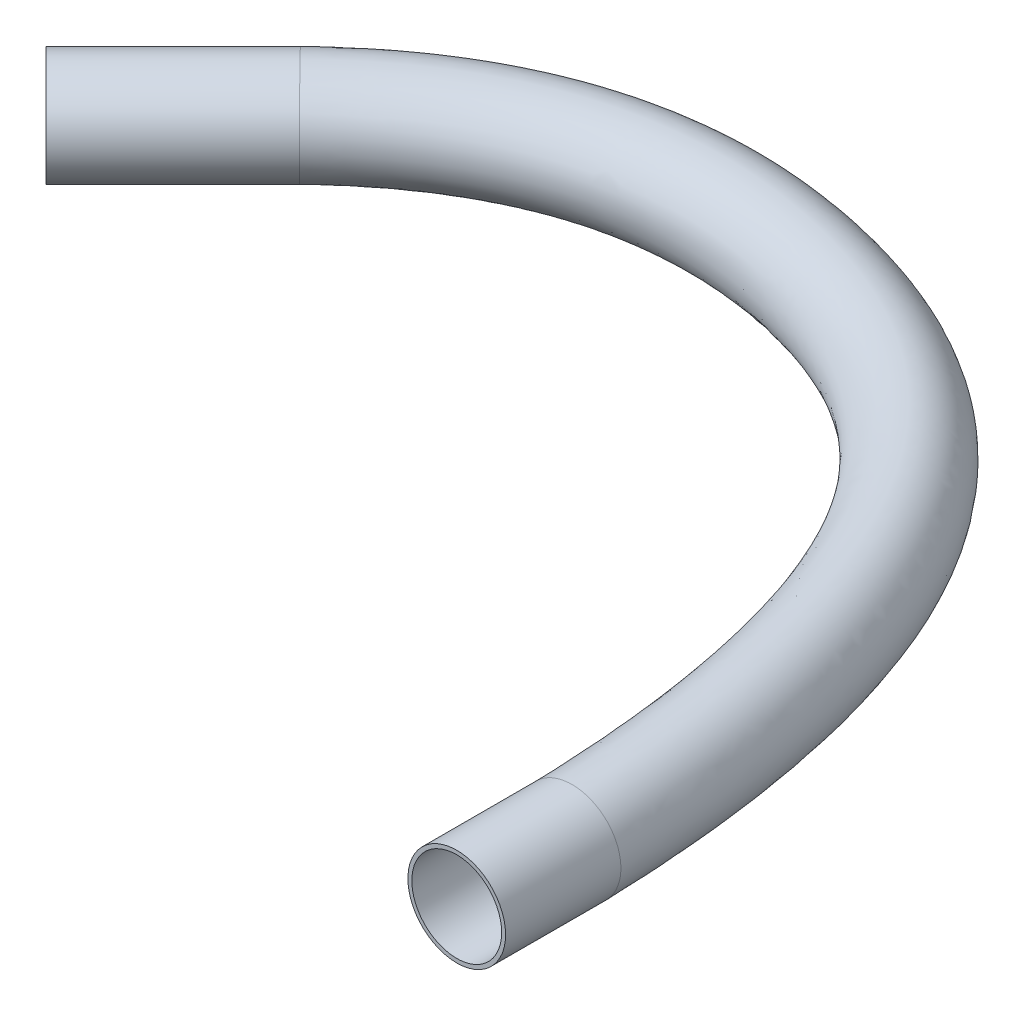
ISO-10303-21;
HEADER;
FILE_DESCRIPTION(('STEP AP214'),'2;1');
FILE_NAME('part.step','',(''),(''),'','','');
FILE_SCHEMA(('AUTOMOTIVE_DESIGN { 1 0 10303 214 1 1 1 1 }'));
ENDSEC;
DATA;
#1=APPLICATION_CONTEXT('core data for automotive mechanical design processes');
#2=APPLICATION_PROTOCOL_DEFINITION('international standard','automotive_design',2000,#1);
#3=PRODUCT_CONTEXT('',#1,'mechanical');
#4=PRODUCT('Part','Part','',(#3));
#5=PRODUCT_RELATED_PRODUCT_CATEGORY('part','',(#4));
#6=PRODUCT_DEFINITION_FORMATION('','',#4);
#7=PRODUCT_DEFINITION_CONTEXT('part definition',#1,'design');
#8=PRODUCT_DEFINITION('design','',#6,#7);
#9=PRODUCT_DEFINITION_SHAPE('','',#8);
#10=(LENGTH_UNIT() NAMED_UNIT(*) SI_UNIT(.MILLI.,.METRE.));
#11=(NAMED_UNIT(*) PLANE_ANGLE_UNIT() SI_UNIT($,.RADIAN.));
#12=(NAMED_UNIT(*) SI_UNIT($,.STERADIAN.) SOLID_ANGLE_UNIT());
#13=UNCERTAINTY_MEASURE_WITH_UNIT(LENGTH_MEASURE(1.E-05),#10,'distance_accuracy_value','');
#14=(GEOMETRIC_REPRESENTATION_CONTEXT(3) GLOBAL_UNCERTAINTY_ASSIGNED_CONTEXT((#13)) GLOBAL_UNIT_ASSIGNED_CONTEXT((#10,
#11,#12)) REPRESENTATION_CONTEXT('',''));
#15=CARTESIAN_POINT('',(0.,0.,0.));
#16=DIRECTION('',(0.,0.,1.));
#17=DIRECTION('',(1.,0.,0.));
#18=AXIS2_PLACEMENT_3D('',#15,#16,#17);
#19=CARTESIAN_POINT('',(-339.764913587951,0.,-270.465086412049));
#20=DIRECTION('',(-0.707106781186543,0.,0.707106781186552));
#21=DIRECTION('',(0.707106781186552,0.,0.707106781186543));
#22=AXIS2_PLACEMENT_3D('',#19,#20,#21);
#23=CYLINDRICAL_SURFACE('',#22,21.75);
#24=CARTESIAN_POINT('',(-340.000000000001,21.75,-270.229999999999));
#25=CARTESIAN_POINT('',(-339.950616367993,21.7500006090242,-270.179647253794));
#26=CARTESIAN_POINT('',(-339.901229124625,21.7496574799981,-270.129290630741));
#27=CARTESIAN_POINT('',(-339.42449723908,21.7430293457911,-269.64319951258));
#28=CARTESIAN_POINT('',(-338.997104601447,21.7113678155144,-269.207401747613));
#29=CARTESIAN_POINT('',(-338.358652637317,21.6254804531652,-268.55637262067));
#30=CARTESIAN_POINT('',(-338.146191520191,21.5904307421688,-268.339722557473));
#31=CARTESIAN_POINT('',(-337.722439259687,21.5075798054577,-267.907608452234));
#32=CARTESIAN_POINT('',(-337.511148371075,21.4597759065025,-267.692144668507));
#33=CARTESIAN_POINT('',(-336.878729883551,21.2971070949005,-267.047225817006));
#34=CARTESIAN_POINT('',(-336.45995011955,21.1631053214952,-266.620154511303));
#35=CARTESIAN_POINT('',(-335.631806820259,20.8451035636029,-265.775588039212));
#36=CARTESIAN_POINT('',(-335.22244342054,20.6611028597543,-265.358093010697));
#37=CARTESIAN_POINT('',(-334.617929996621,20.3487608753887,-264.741552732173));
#38=CARTESIAN_POINT('',(-334.418085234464,20.2386368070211,-264.537728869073));
#39=CARTESIAN_POINT('',(-334.021879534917,20.0064823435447,-264.133628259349));
#40=CARTESIAN_POINT('',(-333.825517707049,19.8844550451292,-263.933350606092));
#41=CARTESIAN_POINT('',(-333.242054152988,19.5007496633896,-263.338242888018));
#42=CARTESIAN_POINT('',(-332.860553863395,19.2214375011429,-262.949117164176));
#43=CARTESIAN_POINT('',(-332.115698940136,18.6181194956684,-262.189352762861));
#44=CARTESIAN_POINT('',(-331.752332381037,18.2941435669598,-261.81870193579));
#45=CARTESIAN_POINT('',(-331.045990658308,17.6036231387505,-261.098181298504));
#46=CARTESIAN_POINT('',(-330.703015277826,17.2370790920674,-260.748311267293));
#47=CARTESIAN_POINT('',(-330.0398241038,16.4639396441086,-260.071771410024));
#48=CARTESIAN_POINT('',(-329.719613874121,16.0573345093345,-259.74510725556));
#49=CARTESIAN_POINT('',(-329.104314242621,15.2070337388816,-259.117391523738));
#50=CARTESIAN_POINT('',(-328.809224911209,14.7633379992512,-258.816340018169));
#51=CARTESIAN_POINT('',(-328.246228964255,13.8419514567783,-258.241956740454));
#52=CARTESIAN_POINT('',(-327.978325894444,13.3642562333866,-257.96862858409));
#53=CARTESIAN_POINT('',(-327.47164974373,12.3783185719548,-257.451682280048));
#54=CARTESIAN_POINT('',(-327.232876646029,11.8700761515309,-257.208064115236));
#55=CARTESIAN_POINT('',(-326.786179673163,10.8267108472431,-256.75229534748));
#56=CARTESIAN_POINT('',(-326.578252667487,10.2915906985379,-256.540141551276));
#57=CARTESIAN_POINT('',(-326.194695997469,9.19822676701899,-256.148782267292));
#58=CARTESIAN_POINT('',(-326.019066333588,8.63998298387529,-255.969576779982));
#59=CARTESIAN_POINT('',(-325.701355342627,7.50435266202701,-255.645393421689));
#60=CARTESIAN_POINT('',(-325.559273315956,6.92696652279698,-255.50041483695));
#61=CARTESIAN_POINT('',(-325.309662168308,5.75714550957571,-255.24571273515));
#62=CARTESIAN_POINT('',(-325.202133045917,5.16471063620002,-255.135989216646));
#63=CARTESIAN_POINT('',(-325.022394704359,3.96902544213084,-254.952581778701));
#64=CARTESIAN_POINT('',(-324.950184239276,3.36577550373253,-254.878896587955));
#65=CARTESIAN_POINT('',(-324.841590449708,2.15272870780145,-254.768084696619));
#66=CARTESIAN_POINT('',(-324.805207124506,1.54293185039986,-254.730957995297));
#67=CARTESIAN_POINT('',(-324.768526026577,0.321126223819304,-254.693527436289));
#68=CARTESIAN_POINT('',(-324.768228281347,-0.290882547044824,-254.693223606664));
#69=CARTESIAN_POINT('',(-324.803720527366,-1.51276030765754,-254.729441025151));
#70=CARTESIAN_POINT('',(-324.839510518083,-2.12262929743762,-254.765962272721));
#71=CARTESIAN_POINT('',(-324.94692243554,-3.33587359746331,-254.875568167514));
#72=CARTESIAN_POINT('',(-325.018543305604,-3.93924909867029,-254.948651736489));
#73=CARTESIAN_POINT('',(-325.197107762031,-5.13523518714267,-255.130861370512));
#74=CARTESIAN_POINT('',(-325.304051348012,-5.72784577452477,-255.239987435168));
#75=CARTESIAN_POINT('',(-325.552503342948,-6.89809704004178,-255.493506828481));
#76=CARTESIAN_POINT('',(-325.694012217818,-7.47573751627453,-255.637900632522));
#77=CARTESIAN_POINT('',(-326.010588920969,-8.61193377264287,-255.960926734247));
#78=CARTESIAN_POINT('',(-326.185656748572,-9.17048955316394,-256.13955903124));
#79=CARTESIAN_POINT('',(-326.568117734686,-10.264573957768,-256.529800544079));
#80=CARTESIAN_POINT('',(-326.775512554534,-10.8001013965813,-256.741411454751));
#81=CARTESIAN_POINT('',(-327.221147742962,-11.8442915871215,-257.196097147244));
#82=CARTESIAN_POINT('',(-327.459388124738,-12.352954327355,-257.439171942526));
#83=CARTESIAN_POINT('',(-327.964998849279,-13.3397534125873,-257.955031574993));
#84=CARTESIAN_POINT('',(-328.232366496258,-13.8178925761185,-258.227813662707));
#85=CARTESIAN_POINT('',(-328.794348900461,-14.7402957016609,-258.801163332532));
#86=CARTESIAN_POINT('',(-329.088963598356,-15.1845597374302,-259.101730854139));
#87=CARTESIAN_POINT('',(-329.703319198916,-16.0360135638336,-259.728484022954));
#88=CARTESIAN_POINT('',(-330.023057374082,-16.4432073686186,-260.054666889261));
#89=CARTESIAN_POINT('',(-330.68540302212,-17.2176727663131,-260.730344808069));
#90=CARTESIAN_POINT('',(-331.028010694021,-17.5849440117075,-261.079840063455));
#91=CARTESIAN_POINT('',(-331.733898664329,-18.2771694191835,-261.79989851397));
#92=CARTESIAN_POINT('',(-332.097189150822,-18.6021024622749,-262.170472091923));
#93=CARTESIAN_POINT('',(-332.655409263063,-19.0557490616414,-262.739866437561));
#94=CARTESIAN_POINT('',(-332.843702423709,-19.201342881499,-262.931926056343));
#95=CARTESIAN_POINT('',(-333.224470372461,-19.4811022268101,-263.320304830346));
#96=CARTESIAN_POINT('',(-333.416946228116,-19.6152647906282,-263.516625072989));
#97=CARTESIAN_POINT('',(-334.000318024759,-20.0003375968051,-264.111639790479));
#98=CARTESIAN_POINT('',(-334.396978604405,-20.2336870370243,-264.516205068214));
#99=CARTESIAN_POINT('',(-335.202675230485,-20.6517576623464,-265.337931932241));
#100=CARTESIAN_POINT('',(-335.611711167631,-20.8364792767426,-265.755093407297));
#101=CARTESIAN_POINT('',(-336.231916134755,-21.0759620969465,-266.387598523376));
#102=CARTESIAN_POINT('',(-336.43960217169,-21.1494822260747,-266.599400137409));
#103=CARTESIAN_POINT('',(-336.85690681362,-21.2839487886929,-267.024967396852));
#104=CARTESIAN_POINT('',(-337.066524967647,-21.3448980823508,-267.238732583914));
#105=CARTESIAN_POINT('',(-337.697632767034,-21.5086862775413,-267.882315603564));
#106=CARTESIAN_POINT('',(-338.121651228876,-21.5925718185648,-268.314701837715));
#107=CARTESIAN_POINT('',(-338.764137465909,-21.6805079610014,-268.969845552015));
#108=CARTESIAN_POINT('',(-338.981439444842,-21.7035358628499,-269.191424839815));
#109=CARTESIAN_POINT('',(-339.416433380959,-21.7362503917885,-269.634973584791));
#110=CARTESIAN_POINT('',(-339.634125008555,-21.7459453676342,-269.85694271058));
#111=CARTESIAN_POINT('',(-339.90122714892,-21.7496571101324,-270.129288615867));
#112=CARTESIAN_POINT('',(-339.950614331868,-21.7500002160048,-270.179645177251));
#113=CARTESIAN_POINT('',(-340.000000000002,-21.75,-270.229999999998));
#114=B_SPLINE_CURVE_WITH_KNOTS('',3,(#24,#25,#26,#27,#28,#29,#30,#31,#32,#33,#34,#35,#36,#37,
#38,#39,#40,#41,#42,#43,#44,#45,#46,#47,#48,#49,#50,#51,#52,#53,#54,#55,#56,#57,#58,#59,#60,#61,
#62,#63,#64,#65,#66,#67,#68,#69,#70,#71,#72,#73,#74,#75,#76,#77,#78,#79,#80,#81,#82,#83,#84,#85,
#86,#87,#88,#89,#90,#91,#92,#93,#94,#95,#96,#97,#98,#99,#100,#101,#102,#103,#104,#105,#106,#107,
#108,#109,#110,#111,#112,#113),.UNSPECIFIED.,.F.,.F.,(4,2,2,2,2,2,2,2,2,2,2,2,2,2,2,2,2,2,2,2,2,
2,2,2,2,2,2,2,2,2,2,2,2,2,2,2,2,2,2,2,2,2,2,2,4),(0.,0.21159695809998,2.04250496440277,
2.95868211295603,3.87505144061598,5.71162346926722,7.54822192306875,8.46585252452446,
9.38324503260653,11.2179369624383,13.0514059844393,14.8848555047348,16.7187515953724,
18.5526528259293,20.3867929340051,22.2209319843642,24.0548847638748,25.8888375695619,
27.7227521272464,29.5566666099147,31.3905163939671,33.2243661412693,35.0582172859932,
36.8920684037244,38.7258654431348,40.5596624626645,42.3934842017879,44.2273059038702,
46.0612218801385,47.8951386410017,49.7288858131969,51.5626289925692,53.3961733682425,
55.2297337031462,57.0642051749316,57.9814948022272,58.8990213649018,60.7349570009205,
62.5708764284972,63.4874691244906,64.4038530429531,66.2354018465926,67.1688049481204,
68.1016233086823,68.3132202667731),.UNSPECIFIED.);
#115=CARTESIAN_POINT('',(-340.000000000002,-21.75,-270.229999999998));
#116=VERTEX_POINT('',#115);
#117=CARTESIAN_POINT('',(-340.000000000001,21.75,-270.229999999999));
#118=VERTEX_POINT('',#117);
#119=EDGE_CURVE('E83',#116,#118,#114,.F.);
#120=ORIENTED_EDGE('',*,*,#119,.T.);
#121=CARTESIAN_POINT('',(-340.000000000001,21.75,-270.229999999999));
#122=CARTESIAN_POINT('',(-340.049383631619,21.7500006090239,-270.280352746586));
#123=CARTESIAN_POINT('',(-340.098770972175,21.7496574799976,-270.330709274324));
#124=CARTESIAN_POINT('',(-340.575503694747,21.7430293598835,-270.816797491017));
#125=CARTESIAN_POINT('',(-341.002904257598,21.7113679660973,-271.252585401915));
#126=CARTESIAN_POINT('',(-341.641378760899,21.6254809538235,-271.903589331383));
#127=CARTESIAN_POINT('',(-341.853849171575,21.5904313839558,-272.12022925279));
#128=CARTESIAN_POINT('',(-342.277623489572,21.5075807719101,-272.552319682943));
#129=CARTESIAN_POINT('',(-342.488927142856,21.4597770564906,-272.767769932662));
#130=CARTESIAN_POINT('',(-343.121389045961,21.2971088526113,-273.41264316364));
#131=CARTESIAN_POINT('',(-343.540204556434,21.1631075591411,-273.839677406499));
#132=CARTESIAN_POINT('',(-344.368431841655,20.8451068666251,-274.684157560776));
#133=CARTESIAN_POINT('',(-344.777843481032,20.6611067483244,-275.101603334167));
#134=CARTESIAN_POINT('',(-345.382437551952,20.3487656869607,-275.718061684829));
#135=CARTESIAN_POINT('',(-345.582310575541,20.2386419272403,-275.921856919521));
#136=CARTESIAN_POINT('',(-345.978575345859,20.0064880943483,-276.325897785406));
#137=CARTESIAN_POINT('',(-346.1749679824,19.8844611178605,-276.526144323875));
#138=CARTESIAN_POINT('',(-346.75852748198,19.5007567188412,-277.121155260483));
#139=CARTESIAN_POINT('',(-347.14009643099,19.2214452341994,-277.510211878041));
#140=CARTESIAN_POINT('',(-347.885096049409,18.6181286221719,-278.269830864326));
#141=CARTESIAN_POINT('',(-348.248538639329,18.2941534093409,-278.640405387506));
#142=CARTESIAN_POINT('',(-348.955037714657,17.6036344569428,-279.360768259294));
#143=CARTESIAN_POINT('',(-349.29809441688,17.237091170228,-279.710556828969));
#144=CARTESIAN_POINT('',(-349.961450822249,16.463953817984,-280.386930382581));
#145=CARTESIAN_POINT('',(-350.281744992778,16.0573500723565,-280.713509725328));
#146=CARTESIAN_POINT('',(-350.897213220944,15.2070522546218,-281.341055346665));
#147=CARTESIAN_POINT('',(-351.192387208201,14.7633580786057,-281.642021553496));
#148=CARTESIAN_POINT('',(-351.755550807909,13.8419748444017,-282.216236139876));
#149=CARTESIAN_POINT('',(-352.023536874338,13.3642813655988,-282.48948090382));
#150=CARTESIAN_POINT('',(-352.530375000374,12.3783473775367,-283.006264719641));
#151=CARTESIAN_POINT('',(-352.769227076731,11.8701068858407,-283.249803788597));
#152=CARTESIAN_POINT('',(-353.216076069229,10.8267448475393,-283.705421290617));
#153=CARTESIAN_POINT('',(-353.424076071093,10.2916259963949,-283.917502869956));
#154=CARTESIAN_POINT('',(-353.807770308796,9.1982647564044,-284.308726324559));
#155=CARTESIAN_POINT('',(-353.983464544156,8.64002236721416,-284.487868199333));
#156=CARTESIAN_POINT('',(-354.301294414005,7.50439490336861,-284.811934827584));
#157=CARTESIAN_POINT('',(-354.443430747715,6.92701022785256,-284.956860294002));
#158=CARTESIAN_POINT('',(-354.693138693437,5.7571921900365,-285.21146824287));
#159=CARTESIAN_POINT('',(-354.800710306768,5.16475882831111,-285.321150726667));
#160=CARTESIAN_POINT('',(-354.980520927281,3.96907449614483,-285.504489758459));
#161=CARTESIAN_POINT('',(-355.052761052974,3.36582386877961,-285.578147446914));
#162=CARTESIAN_POINT('',(-355.16140004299,2.15277561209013,-285.688918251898));
#163=CARTESIAN_POINT('',(-355.197798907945,1.54297798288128,-285.726031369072));
#164=CARTESIAN_POINT('',(-355.234496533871,0.321170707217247,-285.763449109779));
#165=CARTESIAN_POINT('',(-355.234795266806,-0.2908389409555,-285.763753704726));
#166=CARTESIAN_POINT('',(-355.199290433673,-1.51271856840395,-285.727552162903));
#167=CARTESIAN_POINT('',(-355.163486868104,-2.12258854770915,-285.691046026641));
#168=CARTESIAN_POINT('',(-355.056033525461,-3.33583636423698,-285.581484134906));
#169=CARTESIAN_POINT('',(-354.984384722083,-3.93921437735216,-285.508429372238));
#170=CARTESIAN_POINT('',(-354.805750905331,-5.13520556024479,-285.326290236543));
#171=CARTESIAN_POINT('',(-354.698765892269,-5.72781873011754,-285.217205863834));
#172=CARTESIAN_POINT('',(-354.450218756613,-6.89807519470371,-284.963781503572));
#173=CARTESIAN_POINT('',(-354.30865616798,-7.4757182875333,-284.819441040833));
#174=CARTESIAN_POINT('',(-353.991961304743,-8.61191976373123,-284.49653169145));
#175=CARTESIAN_POINT('',(-353.81682903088,-9.17047814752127,-284.31796280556));
#176=CARTESIAN_POINT('',(-353.434230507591,-10.2645670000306,-283.927856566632));
#177=CARTESIAN_POINT('',(-353.226762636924,-10.8000963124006,-283.716317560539));
#178=CARTESIAN_POINT('',(-352.780974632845,-11.8442901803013,-283.261781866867));
#179=CARTESIAN_POINT('',(-352.542654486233,-12.352954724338,-283.01878516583));
#180=CARTESIAN_POINT('',(-352.036879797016,-13.3397572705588,-282.503085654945));
#181=CARTESIAN_POINT('',(-351.769427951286,-13.8178980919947,-282.230385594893));
#182=CARTESIAN_POINT('',(-351.207275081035,-14.74030432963,-281.65720157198));
#183=CARTESIAN_POINT('',(-350.91257411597,-15.1845698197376,-281.35671766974));
#184=CARTESIAN_POINT('',(-350.29804820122,-16.0360237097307,-280.730132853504));
#185=CARTESIAN_POINT('',(-349.978226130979,-16.4432163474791,-280.404034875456));
#186=CARTESIAN_POINT('',(-349.315715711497,-17.2176795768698,-279.728523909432));
#187=CARTESIAN_POINT('',(-348.973027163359,-17.5849498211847,-279.379110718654));
#188=CARTESIAN_POINT('',(-348.266982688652,-18.2771733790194,-278.65921136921));
#189=CARTESIAN_POINT('',(-347.903616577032,-18.6021055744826,-278.288714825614));
#190=CARTESIAN_POINT('',(-347.34528861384,-19.0557510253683,-277.719430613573));
#191=CARTESIAN_POINT('',(-347.156960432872,-19.2013444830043,-277.527406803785));
#192=CARTESIAN_POINT('',(-346.77612453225,-19.4811031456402,-277.139097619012));
#193=CARTESIAN_POINT('',(-346.583615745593,-19.6152653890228,-276.94281115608));
#194=CARTESIAN_POINT('',(-346.000148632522,-20.0003372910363,-276.347894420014));
#195=CARTESIAN_POINT('',(-345.603429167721,-20.2336862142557,-275.943389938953));
#196=CARTESIAN_POINT('',(-344.79762582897,-20.6517560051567,-275.121773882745));
#197=CARTESIAN_POINT('',(-344.388542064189,-20.8364773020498,-274.70466241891));
#198=CARTESIAN_POINT('',(-343.768274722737,-21.0759598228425,-274.07222314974));
#199=CARTESIAN_POINT('',(-343.560569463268,-21.1494798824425,-273.860441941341));
#200=CARTESIAN_POINT('',(-343.143229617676,-21.2839463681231,-273.434912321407));
#201=CARTESIAN_POINT('',(-342.933595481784,-21.3448956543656,-273.221164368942));
#202=CARTESIAN_POINT('',(-342.302444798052,-21.5086839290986,-272.577628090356));
#203=CARTESIAN_POINT('',(-341.878404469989,-21.5925696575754,-272.14526643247));
#204=CARTESIAN_POINT('',(-341.235892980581,-21.6805067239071,-271.490146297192));
#205=CARTESIAN_POINT('',(-341.018582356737,-21.7035350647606,-271.268571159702));
#206=CARTESIAN_POINT('',(-340.583574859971,-21.7362501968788,-270.825027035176));
#207=CARTESIAN_POINT('',(-340.36587831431,-21.7459453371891,-270.603058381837));
#208=CARTESIAN_POINT('',(-340.098772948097,-21.7496571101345,-270.330711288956));
#209=CARTESIAN_POINT('',(-340.049385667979,-21.7500002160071,-270.280354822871));
#210=CARTESIAN_POINT('',(-340.000000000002,-21.75,-270.229999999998));
#211=B_SPLINE_CURVE_WITH_KNOTS('',3,(#121,#122,#123,#124,#125,#126,#127,#128,#129,#130,#131,
#132,#133,#134,#135,#136,#137,#138,#139,#140,#141,#142,#143,#144,#145,#146,#147,#148,#149,#150,
#151,#152,#153,#154,#155,#156,#157,#158,#159,#160,#161,#162,#163,#164,#165,#166,#167,#168,#169,
#170,#171,#172,#173,#174,#175,#176,#177,#178,#179,#180,#181,#182,#183,#184,#185,#186,#187,#188,
#189,#190,#191,#192,#193,#194,#195,#196,#197,#198,#199,#200,#201,#202,#203,#204,#205,#206,#207,
#208,#209,#210),.UNSPECIFIED.,.F.,.F.,(4,2,2,2,2,2,2,2,2,2,2,2,2,2,2,2,2,2,2,2,2,2,2,2,2,2,2,2,
2,2,2,2,2,2,2,2,2,2,2,2,2,2,2,2,4),(0.,0.211596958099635,2.04250050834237,2.95867542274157,
3.87504251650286,5.71161004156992,7.54820398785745,8.46583242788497,9.38322277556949,
11.217910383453,13.0513750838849,14.8848202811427,16.718709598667,18.5526040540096,
20.3867373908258,22.2208696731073,24.0548183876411,25.8887671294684,27.7226776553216,
29.5565881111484,31.3904405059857,33.2242928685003,35.0581466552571,36.8920004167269,
38.7258043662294,40.5596082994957,42.3934369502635,44.2272655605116,46.0611861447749,
47.8951075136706,49.7288592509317,51.5626069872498,53.3961448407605,55.2296986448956,
57.0641635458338,57.9814498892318,58.8989731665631,60.7349021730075,62.5708149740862,
63.4874043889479,64.4037850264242,66.23532728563,67.1687397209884,68.1015674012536,
68.3131643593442),.UNSPECIFIED.);
#212=EDGE_CURVE('E40',#116,#118,#211,.F.);
#213=ORIENTED_EDGE('',*,*,#212,.F.);
#214=EDGE_LOOP('',(#120,#213));
#215=FACE_BOUND('',#214,.T.);
#216=CARTESIAN_POINT('',(-396.568542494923,0.,-213.661457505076));
#217=DIRECTION('',(0.707106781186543,0.,-0.707106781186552));
#218=DIRECTION('',(-0.707106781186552,0.,-0.707106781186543));
#219=AXIS2_PLACEMENT_3D('',#216,#217,#218);
#220=CIRCLE('',#219,21.75);
#221=CARTESIAN_POINT('',(-411.948114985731,0.,-229.041029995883));
#222=VERTEX_POINT('',#221);
#223=EDGE_CURVE('E55',#222,#222,#220,.T.);
#224=ORIENTED_EDGE('',*,*,#223,.T.);
#225=EDGE_LOOP('',(#224));
#226=FACE_BOUND('',#225,.T.);
#227=ADVANCED_FACE('F37',(#215,#226),#23,.T.);
#228=CARTESIAN_POINT('',(21.754454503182,0.,-51.2214302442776));
#229=CARTESIAN_POINT('',(21.749062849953,0.,-51.3855983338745));
#230=CARTESIAN_POINT('',(21.74374779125,0.,-51.5474359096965));
#231=CARTESIAN_POINT('',(21.6925637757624,0.,-53.1058998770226));
#232=CARTESIAN_POINT('',(21.6419687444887,0.,-54.5307737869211));
#233=CARTESIAN_POINT('',(21.5348755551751,0.,-57.3294867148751));
#234=CARTESIAN_POINT('',(21.4777379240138,0.,-58.7228108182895));
#235=CARTESIAN_POINT('',(21.2955793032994,0.,-62.8847737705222));
#236=CARTESIAN_POINT('',(21.1598127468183,0.,-65.635403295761));
#237=CARTESIAN_POINT('',(20.7097440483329,0.,-73.8159552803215));
#238=CARTESIAN_POINT('',(20.3526756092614,0.,-79.1745420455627));
#239=CARTESIAN_POINT('',(19.1120145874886,0.,-94.9705392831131));
#240=CARTESIAN_POINT('',(18.059014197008,0.,-105.128215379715));
#241=CARTESIAN_POINT('',(14.2335905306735,0.,-134.526182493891));
#242=CARTESIAN_POINT('',(10.7954657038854,0.,-152.692571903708));
#243=CARTESIAN_POINT('',(2.1854609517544,0.,-186.376745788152));
#244=CARTESIAN_POINT('',(-2.98734273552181,0.,-201.895783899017));
#245=CARTESIAN_POINT('',(-15.0383557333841,0.,-230.450315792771));
#246=CARTESIAN_POINT('',(-21.9189405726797,0.,-243.486111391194));
#247=CARTESIAN_POINT('',(-37.3219599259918,0.,-267.156318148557));
#248=CARTESIAN_POINT('',(-45.8462593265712,0.,-277.78797539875));
#249=CARTESIAN_POINT('',(-64.3630232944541,0.,-296.679500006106));
#250=CARTESIAN_POINT('',(-74.3532501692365,0.,-304.935551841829));
#251=CARTESIAN_POINT('',(-95.5127972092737,0.,-319.165480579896));
#252=CARTESIAN_POINT('',(-106.678035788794,0.,-325.139420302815));
#253=CARTESIAN_POINT('',(-129.893735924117,0.,-335.026339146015));
#254=CARTESIAN_POINT('',(-141.943068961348,0.,-338.942022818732));
#255=CARTESIAN_POINT('',(-169.148733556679,0.,-345.607852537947));
#256=CARTESIAN_POINT('',(-184.826600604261,0.,-348.073195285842));
#257=CARTESIAN_POINT('',(-217.476231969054,0.,-349.245293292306));
#258=CARTESIAN_POINT('',(-234.451672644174,0.,-347.941346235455));
#259=CARTESIAN_POINT('',(-268.964414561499,0.,-340.177903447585));
#260=CARTESIAN_POINT('',(-286.485653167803,0.,-333.711989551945));
#261=CARTESIAN_POINT('',(-312.511302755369,0.,-319.385470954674));
#262=CARTESIAN_POINT('',(-321.144751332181,0.,-313.842415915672));
#263=CARTESIAN_POINT('',(-333.971972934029,0.,-304.302894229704));
#264=CARTESIAN_POINT('',(-338.227435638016,0.,-300.918956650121));
#265=CARTESIAN_POINT('',(-344.574539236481,0.,-295.527753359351));
#266=CARTESIAN_POINT('',(-346.684237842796,0.,-293.678133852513));
#267=CARTESIAN_POINT('',(-349.839177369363,0.,-290.823701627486));
#268=CARTESIAN_POINT('',(-350.889223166,0.,-289.85889011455));
#269=CARTESIAN_POINT('',(-352.461821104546,0.,-288.391522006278));
#270=CARTESIAN_POINT('',(-352.98560866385,0.,-287.899040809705));
#271=CARTESIAN_POINT('',(-353.7706640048,0.,-287.155262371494));
#272=CARTESIAN_POINT('',(-354.032244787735,0.,-286.906493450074));
#273=CARTESIAN_POINT('',(-354.555196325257,0.,-286.407266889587));
#274=CARTESIAN_POINT('',(-354.826411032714,0.,-286.147340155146));
#275=CARTESIAN_POINT('',(-355.160956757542,0.,-285.825550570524));
#276=CARTESIAN_POINT('',(-355.237572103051,0.,-285.75185624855));
#277=CARTESIAN_POINT('',(-355.317442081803,0.,-285.675031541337));
#278=CARTESIAN_POINT('',(21.754454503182,43.5,-51.2214302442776));
#279=CARTESIAN_POINT('',(21.749062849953,43.5,-51.3855983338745));
#280=CARTESIAN_POINT('',(21.74374779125,43.5,-51.5474359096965));
#281=CARTESIAN_POINT('',(21.6925637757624,43.5,-53.1058998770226));
#282=CARTESIAN_POINT('',(21.6419687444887,43.5,-54.5307737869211));
#283=CARTESIAN_POINT('',(21.5348755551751,43.5,-57.3294867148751));
#284=CARTESIAN_POINT('',(21.4777379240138,43.5,-58.7228108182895));
#285=CARTESIAN_POINT('',(21.2955793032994,43.5,-62.8847737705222));
#286=CARTESIAN_POINT('',(21.1598127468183,43.5,-65.635403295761));
#287=CARTESIAN_POINT('',(20.7097440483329,43.5,-73.8159552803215));
#288=CARTESIAN_POINT('',(20.3526756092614,43.5,-79.1745420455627));
#289=CARTESIAN_POINT('',(19.1120145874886,43.5,-94.9705392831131));
#290=CARTESIAN_POINT('',(18.059014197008,43.5,-105.128215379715));
#291=CARTESIAN_POINT('',(14.2335905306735,43.5,-134.526182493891));
#292=CARTESIAN_POINT('',(10.7954657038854,43.5,-152.692571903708));
#293=CARTESIAN_POINT('',(2.1854609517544,43.5,-186.376745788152));
#294=CARTESIAN_POINT('',(-2.98734273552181,43.5,-201.895783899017));
#295=CARTESIAN_POINT('',(-15.0383557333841,43.5,-230.450315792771));
#296=CARTESIAN_POINT('',(-21.9189405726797,43.5,-243.486111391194));
#297=CARTESIAN_POINT('',(-37.3219599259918,43.5,-267.156318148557));
#298=CARTESIAN_POINT('',(-45.8462593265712,43.5,-277.78797539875));
#299=CARTESIAN_POINT('',(-64.3630232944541,43.5,-296.679500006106));
#300=CARTESIAN_POINT('',(-74.3532501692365,43.5,-304.935551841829));
#301=CARTESIAN_POINT('',(-95.5127972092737,43.5,-319.165480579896));
#302=CARTESIAN_POINT('',(-106.678035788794,43.5,-325.139420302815));
#303=CARTESIAN_POINT('',(-129.893735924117,43.5,-335.026339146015));
#304=CARTESIAN_POINT('',(-141.943068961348,43.5,-338.942022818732));
#305=CARTESIAN_POINT('',(-169.148733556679,43.5,-345.607852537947));
#306=CARTESIAN_POINT('',(-184.826600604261,43.5,-348.073195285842));
#307=CARTESIAN_POINT('',(-217.476231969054,43.5,-349.245293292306));
#308=CARTESIAN_POINT('',(-234.451672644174,43.5,-347.941346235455));
#309=CARTESIAN_POINT('',(-268.964414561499,43.5,-340.177903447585));
#310=CARTESIAN_POINT('',(-286.485653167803,43.5,-333.711989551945));
#311=CARTESIAN_POINT('',(-312.511302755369,43.5,-319.385470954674));
#312=CARTESIAN_POINT('',(-321.144751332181,43.5,-313.842415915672));
#313=CARTESIAN_POINT('',(-333.971972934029,43.5,-304.302894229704));
#314=CARTESIAN_POINT('',(-338.227435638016,43.5,-300.918956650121));
#315=CARTESIAN_POINT('',(-344.574539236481,43.5,-295.527753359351));
#316=CARTESIAN_POINT('',(-346.684237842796,43.5,-293.678133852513));
#317=CARTESIAN_POINT('',(-349.839177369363,43.5,-290.823701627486));
#318=CARTESIAN_POINT('',(-350.889223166,43.5,-289.85889011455));
#319=CARTESIAN_POINT('',(-352.461821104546,43.5,-288.391522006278));
#320=CARTESIAN_POINT('',(-352.98560866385,43.5,-287.899040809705));
#321=CARTESIAN_POINT('',(-353.7706640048,43.5,-287.155262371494));
#322=CARTESIAN_POINT('',(-354.032244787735,43.5,-286.906493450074));
#323=CARTESIAN_POINT('',(-354.555196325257,43.5,-286.407266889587));
#324=CARTESIAN_POINT('',(-354.826411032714,43.5,-286.147340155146));
#325=CARTESIAN_POINT('',(-355.160956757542,43.5,-285.825550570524));
#326=CARTESIAN_POINT('',(-355.237572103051,43.5,-285.75185624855));
#327=CARTESIAN_POINT('',(-355.317442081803,43.5,-285.675031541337));
#328=CARTESIAN_POINT('',(-21.7221045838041,43.5,-49.7935612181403));
#329=CARTESIAN_POINT('',(-21.7274962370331,43.5,-49.9577293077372));
#330=CARTESIAN_POINT('',(-21.7329643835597,43.5,-50.1242280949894));
#331=CARTESIAN_POINT('',(-21.7827154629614,43.5,-51.6390620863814));
#332=CARTESIAN_POINT('',(-21.8292434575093,43.5,-52.9464870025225));
#333=CARTESIAN_POINT('',(-21.9302884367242,43.5,-55.5871394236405));
#334=CARTESIAN_POINT('',(-21.9841651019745,43.5,-56.9008833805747));
#335=CARTESIAN_POINT('',(-22.1558015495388,43.5,-60.8224355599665));
#336=CARTESIAN_POINT('',(-22.2835679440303,43.5,-63.4105640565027));
#337=CARTESIAN_POINT('',(-22.7064391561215,43.5,-71.0967682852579));
#338=CARTESIAN_POINT('',(-23.0411187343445,43.5,-76.116661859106));
#339=CARTESIAN_POINT('',(-24.1997247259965,43.5,-90.8679409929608));
#340=CARTESIAN_POINT('',(-25.1782662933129,43.5,-100.290896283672));
#341=CARTESIAN_POINT('',(-28.7008301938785,43.5,-127.361418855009));
#342=CARTESIAN_POINT('',(-31.8325126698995,43.5,-143.809483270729));
#343=CARTESIAN_POINT('',(-39.4765262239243,43.5,-173.714493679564));
#344=CARTESIAN_POINT('',(-43.9879335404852,43.5,-187.170186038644));
#345=CARTESIAN_POINT('',(-54.1918521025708,43.5,-211.34808030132));
#346=CARTESIAN_POINT('',(-59.8819878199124,43.5,-222.069980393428));
#347=CARTESIAN_POINT('',(-72.2790249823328,43.5,-241.120818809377));
#348=CARTESIAN_POINT('',(-78.9840615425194,43.5,-249.452511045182));
#349=CARTESIAN_POINT('',(-93.3566907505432,43.5,-264.116027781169));
#350=CARTESIAN_POINT('',(-101.02652109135,43.5,-270.451667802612));
#351=CARTESIAN_POINT('',(-117.389915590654,43.5,-281.456153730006));
#352=CARTESIAN_POINT('',(-126.087561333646,43.5,-286.1249368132));
#353=CARTESIAN_POINT('',(-144.572562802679,43.5,-293.997183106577));
#354=CARTESIAN_POINT('',(-154.361047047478,43.5,-297.197941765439));
#355=CARTESIAN_POINT('',(-177.029803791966,43.5,-302.752155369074));
#356=CARTESIAN_POINT('',(-189.764547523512,43.5,-304.722442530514));
#357=CARTESIAN_POINT('',(-215.659511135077,43.5,-305.652052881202));
#358=CARTESIAN_POINT('',(-228.816054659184,43.5,-304.622078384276));
#359=CARTESIAN_POINT('',(-255.506975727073,43.5,-298.61810920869));
#360=CARTESIAN_POINT('',(-269.057415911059,43.5,-293.650532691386));
#361=CARTESIAN_POINT('',(-289.759296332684,43.5,-282.254625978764));
#362=CARTESIAN_POINT('',(-296.721693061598,43.5,-277.794840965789));
#363=CARTESIAN_POINT('',(-307.245147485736,43.5,-269.968616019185));
#364=CARTESIAN_POINT('',(-310.766061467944,43.5,-267.170390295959));
#365=CARTESIAN_POINT('',(-316.06361305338,43.5,-262.670672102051));
#366=CARTESIAN_POINT('',(-317.832147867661,43.5,-261.120371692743));
#367=CARTESIAN_POINT('',(-320.48843890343,43.5,-258.71709179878));
#368=CARTESIAN_POINT('',(-321.374450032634,43.5,-257.903027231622));
#369=CARTESIAN_POINT('',(-322.70426482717,43.5,-256.662196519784));
#370=CARTESIAN_POINT('',(-323.147669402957,43.5,-256.245297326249));
#371=CARTESIAN_POINT('',(-323.812966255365,43.5,-255.614980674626));
#372=CARTESIAN_POINT('',(-324.034763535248,43.5,-255.404047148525));
#373=CARTESIAN_POINT('',(-324.478419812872,43.5,-254.98051842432));
#374=CARTESIAN_POINT('',(-324.690434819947,43.5,-254.777391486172));
#375=CARTESIAN_POINT('',(-324.998783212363,43.5,-254.48080029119));
#376=CARTESIAN_POINT('',(-325.081907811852,43.5,-254.400844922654));
#377=CARTESIAN_POINT('',(-325.161777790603,43.5,-254.32402021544));
#378=CARTESIAN_POINT('',(-21.7221045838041,0.,-49.7935612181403));
#379=CARTESIAN_POINT('',(-21.7274962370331,0.,-49.9577293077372));
#380=CARTESIAN_POINT('',(-21.7329643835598,0.,-50.1242280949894));
#381=CARTESIAN_POINT('',(-21.7827154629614,0.,-51.6390620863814));
#382=CARTESIAN_POINT('',(-21.8292434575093,0.,-52.9464870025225));
#383=CARTESIAN_POINT('',(-21.9302884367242,0.,-55.5871394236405));
#384=CARTESIAN_POINT('',(-21.9841651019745,0.,-56.900883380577));
#385=CARTESIAN_POINT('',(-22.1558015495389,0.,-60.8224355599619));
#386=CARTESIAN_POINT('',(-22.2835679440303,0.,-63.4105640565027));
#387=CARTESIAN_POINT('',(-22.7064391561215,0.,-71.0967682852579));
#388=CARTESIAN_POINT('',(-23.0411187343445,0.,-76.1166618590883));
#389=CARTESIAN_POINT('',(-24.1997247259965,0.,-90.8679409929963));
#390=CARTESIAN_POINT('',(-25.1782662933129,0.,-100.290896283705));
#391=CARTESIAN_POINT('',(-28.7008301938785,0.,-127.361418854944));
#392=CARTESIAN_POINT('',(-31.8325126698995,0.,-143.809483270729));
#393=CARTESIAN_POINT('',(-39.4765262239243,0.,-173.714493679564));
#394=CARTESIAN_POINT('',(-43.9879335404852,0.,-187.170186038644));
#395=CARTESIAN_POINT('',(-54.1918521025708,0.,-211.34808030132));
#396=CARTESIAN_POINT('',(-59.8819878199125,0.,-222.069980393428));
#397=CARTESIAN_POINT('',(-72.2790249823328,0.,-241.120818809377));
#398=CARTESIAN_POINT('',(-78.9840615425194,0.,-249.452511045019));
#399=CARTESIAN_POINT('',(-93.3566907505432,0.,-264.116027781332));
#400=CARTESIAN_POINT('',(-101.02652109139,0.,-270.451667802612));
#401=CARTESIAN_POINT('',(-117.389915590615,0.,-281.456153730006));
#402=CARTESIAN_POINT('',(-126.087561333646,0.,-286.1249368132));
#403=CARTESIAN_POINT('',(-144.572562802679,0.,-293.997183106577));
#404=CARTESIAN_POINT('',(-154.361047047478,0.,-297.197941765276));
#405=CARTESIAN_POINT('',(-177.029803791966,0.,-302.752155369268));
#406=CARTESIAN_POINT('',(-189.764547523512,0.,-304.722442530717));
#407=CARTESIAN_POINT('',(-215.659511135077,0.,-305.652052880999));
#408=CARTESIAN_POINT('',(-228.816054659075,0.,-304.622078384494));
#409=CARTESIAN_POINT('',(-255.506975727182,0.,-298.618109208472));
#410=CARTESIAN_POINT('',(-269.057415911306,0.,-293.650532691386));
#411=CARTESIAN_POINT('',(-289.75929633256,0.,-282.254625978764));
#412=CARTESIAN_POINT('',(-296.721693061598,0.,-277.794840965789));
#413=CARTESIAN_POINT('',(-307.245147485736,0.,-269.968616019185));
#414=CARTESIAN_POINT('',(-310.766061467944,0.,-267.17039029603));
#415=CARTESIAN_POINT('',(-316.06361305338,0.,-262.670672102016));
#416=CARTESIAN_POINT('',(-317.832147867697,0.,-261.120371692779));
#417=CARTESIAN_POINT('',(-320.488438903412,0.,-258.717091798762));
#418=CARTESIAN_POINT('',(-321.374450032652,0.,-257.903027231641));
#419=CARTESIAN_POINT('',(-322.704264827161,0.,-256.662196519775));
#420=CARTESIAN_POINT('',(-323.147669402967,0.,-256.245297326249));
#421=CARTESIAN_POINT('',(-323.81296625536,0.,-255.614980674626));
#422=CARTESIAN_POINT('',(-324.034763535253,0.,-255.404047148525));
#423=CARTESIAN_POINT('',(-324.478419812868,0.,-254.98051842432));
#424=CARTESIAN_POINT('',(-324.690434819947,0.,-254.777391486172));
#425=CARTESIAN_POINT('',(-324.998783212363,0.,-254.48080029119));
#426=CARTESIAN_POINT('',(-325.081907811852,0.,-254.400844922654));
#427=CARTESIAN_POINT('',(-325.161777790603,0.,-254.32402021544));
#428=CARTESIAN_POINT('',(-21.7221045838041,-43.5,-49.7935612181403));
#429=CARTESIAN_POINT('',(-21.7274962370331,-43.5,-49.9577293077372));
#430=CARTESIAN_POINT('',(-21.7329643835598,-43.5,-50.1242280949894));
#431=CARTESIAN_POINT('',(-21.7827154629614,-43.5,-51.6390620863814));
#432=CARTESIAN_POINT('',(-21.8292434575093,-43.5,-52.9464870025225));
#433=CARTESIAN_POINT('',(-21.9302884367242,-43.5,-55.5871394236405));
#434=CARTESIAN_POINT('',(-21.9841651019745,-43.5,-56.9008833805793));
#435=CARTESIAN_POINT('',(-22.1558015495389,-43.5,-60.8224355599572));
#436=CARTESIAN_POINT('',(-22.2835679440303,-43.5,-63.4105640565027));
#437=CARTESIAN_POINT('',(-22.7064391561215,-43.5,-71.0967682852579));
#438=CARTESIAN_POINT('',(-23.0411187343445,-43.5,-76.1166618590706));
#439=CARTESIAN_POINT('',(-24.1997247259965,-43.5,-90.8679409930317));
#440=CARTESIAN_POINT('',(-25.1782662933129,-43.5,-100.290896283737));
#441=CARTESIAN_POINT('',(-28.7008301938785,-43.5,-127.361418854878));
#442=CARTESIAN_POINT('',(-31.8325126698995,-43.5,-143.809483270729));
#443=CARTESIAN_POINT('',(-39.4765262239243,-43.5,-173.714493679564));
#444=CARTESIAN_POINT('',(-43.9879335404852,-43.5,-187.170186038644));
#445=CARTESIAN_POINT('',(-54.1918521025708,-43.5,-211.34808030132));
#446=CARTESIAN_POINT('',(-59.8819878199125,-43.5,-222.069980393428));
#447=CARTESIAN_POINT('',(-72.2790249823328,-43.5,-241.120818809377));
#448=CARTESIAN_POINT('',(-78.9840615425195,-43.5,-249.452511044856));
#449=CARTESIAN_POINT('',(-93.3566907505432,-43.5,-264.116027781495));
#450=CARTESIAN_POINT('',(-101.026521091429,-43.5,-270.451667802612));
#451=CARTESIAN_POINT('',(-117.389915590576,-43.5,-281.456153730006));
#452=CARTESIAN_POINT('',(-126.087561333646,-43.5,-286.1249368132));
#453=CARTESIAN_POINT('',(-144.572562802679,-43.5,-293.997183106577));
#454=CARTESIAN_POINT('',(-154.361047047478,-43.5,-297.197941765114));
#455=CARTESIAN_POINT('',(-177.029803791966,-43.5,-302.752155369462));
#456=CARTESIAN_POINT('',(-189.764547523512,-43.5,-304.722442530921));
#457=CARTESIAN_POINT('',(-215.659511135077,-43.5,-305.652052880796));
#458=CARTESIAN_POINT('',(-228.816054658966,-43.5,-304.622078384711));
#459=CARTESIAN_POINT('',(-255.506975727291,-43.5,-298.618109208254));
#460=CARTESIAN_POINT('',(-269.057415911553,-43.5,-293.650532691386));
#461=CARTESIAN_POINT('',(-289.759296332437,-43.5,-282.254625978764));
#462=CARTESIAN_POINT('',(-296.721693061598,-43.5,-277.794840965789));
#463=CARTESIAN_POINT('',(-307.245147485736,-43.5,-269.968616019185));
#464=CARTESIAN_POINT('',(-310.766061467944,-43.5,-267.1703902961));
#465=CARTESIAN_POINT('',(-316.06361305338,-43.5,-262.670672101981));
#466=CARTESIAN_POINT('',(-317.832147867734,-43.5,-261.120371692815));
#467=CARTESIAN_POINT('',(-320.488438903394,-43.5,-258.717091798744));
#468=CARTESIAN_POINT('',(-321.374450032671,-43.5,-257.903027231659));
#469=CARTESIAN_POINT('',(-322.704264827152,-43.5,-256.662196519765));
#470=CARTESIAN_POINT('',(-323.147669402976,-43.5,-256.245297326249));
#471=CARTESIAN_POINT('',(-323.812966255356,-43.5,-255.614980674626));
#472=CARTESIAN_POINT('',(-324.034763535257,-43.5,-255.404047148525));
#473=CARTESIAN_POINT('',(-324.478419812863,-43.5,-254.98051842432));
#474=CARTESIAN_POINT('',(-324.690434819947,-43.5,-254.777391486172));
#475=CARTESIAN_POINT('',(-324.998783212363,-43.5,-254.48080029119));
#476=CARTESIAN_POINT('',(-325.081907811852,-43.5,-254.400844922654));
#477=CARTESIAN_POINT('',(-325.161777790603,-43.5,-254.32402021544));
#478=CARTESIAN_POINT('',(21.754454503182,-43.5,-51.2214302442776));
#479=CARTESIAN_POINT('',(21.749062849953,-43.5,-51.3855983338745));
#480=CARTESIAN_POINT('',(21.74374779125,-43.5,-51.5474359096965));
#481=CARTESIAN_POINT('',(21.6925637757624,-43.5,-53.1058998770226));
#482=CARTESIAN_POINT('',(21.6419687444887,-43.5,-54.5307737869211));
#483=CARTESIAN_POINT('',(21.5348755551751,-43.5,-57.3294867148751));
#484=CARTESIAN_POINT('',(21.4777379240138,-43.5,-58.7228108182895));
#485=CARTESIAN_POINT('',(21.2955793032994,-43.5,-62.8847737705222));
#486=CARTESIAN_POINT('',(21.1598127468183,-43.5,-65.635403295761));
#487=CARTESIAN_POINT('',(20.7097440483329,-43.5,-73.8159552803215));
#488=CARTESIAN_POINT('',(20.3526756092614,-43.5,-79.1745420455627));
#489=CARTESIAN_POINT('',(19.1120145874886,-43.5,-94.9705392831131));
#490=CARTESIAN_POINT('',(18.059014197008,-43.5,-105.128215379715));
#491=CARTESIAN_POINT('',(14.2335905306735,-43.5,-134.526182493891));
#492=CARTESIAN_POINT('',(10.7954657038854,-43.5,-152.692571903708));
#493=CARTESIAN_POINT('',(2.1854609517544,-43.5,-186.376745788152));
#494=CARTESIAN_POINT('',(-2.98734273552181,-43.5,-201.895783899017));
#495=CARTESIAN_POINT('',(-15.0383557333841,-43.5,-230.450315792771));
#496=CARTESIAN_POINT('',(-21.9189405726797,-43.5,-243.486111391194));
#497=CARTESIAN_POINT('',(-37.3219599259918,-43.5,-267.156318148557));
#498=CARTESIAN_POINT('',(-45.8462593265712,-43.5,-277.78797539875));
#499=CARTESIAN_POINT('',(-64.3630232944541,-43.5,-296.679500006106));
#500=CARTESIAN_POINT('',(-74.3532501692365,-43.5,-304.935551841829));
#501=CARTESIAN_POINT('',(-95.5127972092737,-43.5,-319.165480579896));
#502=CARTESIAN_POINT('',(-106.678035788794,-43.5,-325.139420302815));
#503=CARTESIAN_POINT('',(-129.893735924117,-43.5,-335.026339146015));
#504=CARTESIAN_POINT('',(-141.943068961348,-43.5,-338.942022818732));
#505=CARTESIAN_POINT('',(-169.148733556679,-43.5,-345.607852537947));
#506=CARTESIAN_POINT('',(-184.826600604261,-43.5,-348.073195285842));
#507=CARTESIAN_POINT('',(-217.476231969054,-43.5,-349.245293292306));
#508=CARTESIAN_POINT('',(-234.451672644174,-43.5,-347.941346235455));
#509=CARTESIAN_POINT('',(-268.964414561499,-43.5,-340.177903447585));
#510=CARTESIAN_POINT('',(-286.485653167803,-43.5,-333.711989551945));
#511=CARTESIAN_POINT('',(-312.511302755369,-43.5,-319.385470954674));
#512=CARTESIAN_POINT('',(-321.144751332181,-43.5,-313.842415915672));
#513=CARTESIAN_POINT('',(-333.971972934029,-43.5,-304.302894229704));
#514=CARTESIAN_POINT('',(-338.227435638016,-43.5,-300.918956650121));
#515=CARTESIAN_POINT('',(-344.574539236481,-43.5,-295.527753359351));
#516=CARTESIAN_POINT('',(-346.684237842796,-43.5,-293.678133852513));
#517=CARTESIAN_POINT('',(-349.839177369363,-43.5,-290.823701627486));
#518=CARTESIAN_POINT('',(-350.889223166,-43.5,-289.85889011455));
#519=CARTESIAN_POINT('',(-352.461821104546,-43.5,-288.391522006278));
#520=CARTESIAN_POINT('',(-352.98560866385,-43.5,-287.899040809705));
#521=CARTESIAN_POINT('',(-353.7706640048,-43.5,-287.155262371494));
#522=CARTESIAN_POINT('',(-354.032244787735,-43.5,-286.906493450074));
#523=CARTESIAN_POINT('',(-354.555196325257,-43.5,-286.407266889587));
#524=CARTESIAN_POINT('',(-354.826411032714,-43.5,-286.147340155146));
#525=CARTESIAN_POINT('',(-355.160956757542,-43.5,-285.825550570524));
#526=CARTESIAN_POINT('',(-355.237572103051,-43.5,-285.75185624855));
#527=CARTESIAN_POINT('',(-355.317442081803,-43.5,-285.675031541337));
#528=CARTESIAN_POINT('',(21.754454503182,0.,-51.2214302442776));
#529=CARTESIAN_POINT('',(21.749062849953,0.,-51.3855983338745));
#530=CARTESIAN_POINT('',(21.74374779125,0.,-51.5474359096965));
#531=CARTESIAN_POINT('',(21.6925637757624,0.,-53.1058998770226));
#532=CARTESIAN_POINT('',(21.6419687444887,0.,-54.5307737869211));
#533=CARTESIAN_POINT('',(21.5348755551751,0.,-57.3294867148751));
#534=CARTESIAN_POINT('',(21.4777379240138,0.,-58.7228108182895));
#535=CARTESIAN_POINT('',(21.2955793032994,0.,-62.8847737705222));
#536=CARTESIAN_POINT('',(21.1598127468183,0.,-65.635403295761));
#537=CARTESIAN_POINT('',(20.7097440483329,0.,-73.8159552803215));
#538=CARTESIAN_POINT('',(20.3526756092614,0.,-79.1745420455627));
#539=CARTESIAN_POINT('',(19.1120145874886,0.,-94.9705392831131));
#540=CARTESIAN_POINT('',(18.059014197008,0.,-105.128215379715));
#541=CARTESIAN_POINT('',(14.2335905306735,0.,-134.526182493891));
#542=CARTESIAN_POINT('',(10.7954657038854,0.,-152.692571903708));
#543=CARTESIAN_POINT('',(2.1854609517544,0.,-186.376745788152));
#544=CARTESIAN_POINT('',(-2.98734273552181,0.,-201.895783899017));
#545=CARTESIAN_POINT('',(-15.0383557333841,0.,-230.450315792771));
#546=CARTESIAN_POINT('',(-21.9189405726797,0.,-243.486111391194));
#547=CARTESIAN_POINT('',(-37.3219599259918,0.,-267.156318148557));
#548=CARTESIAN_POINT('',(-45.8462593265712,0.,-277.78797539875));
#549=CARTESIAN_POINT('',(-64.3630232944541,0.,-296.679500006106));
#550=CARTESIAN_POINT('',(-74.3532501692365,0.,-304.935551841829));
#551=CARTESIAN_POINT('',(-95.5127972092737,0.,-319.165480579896));
#552=CARTESIAN_POINT('',(-106.678035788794,0.,-325.139420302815));
#553=CARTESIAN_POINT('',(-129.893735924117,0.,-335.026339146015));
#554=CARTESIAN_POINT('',(-141.943068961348,0.,-338.942022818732));
#555=CARTESIAN_POINT('',(-169.148733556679,0.,-345.607852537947));
#556=CARTESIAN_POINT('',(-184.826600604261,0.,-348.073195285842));
#557=CARTESIAN_POINT('',(-217.476231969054,0.,-349.245293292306));
#558=CARTESIAN_POINT('',(-234.451672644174,0.,-347.941346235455));
#559=CARTESIAN_POINT('',(-268.964414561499,0.,-340.177903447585));
#560=CARTESIAN_POINT('',(-286.485653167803,0.,-333.711989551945));
#561=CARTESIAN_POINT('',(-312.511302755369,0.,-319.385470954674));
#562=CARTESIAN_POINT('',(-321.144751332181,0.,-313.842415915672));
#563=CARTESIAN_POINT('',(-333.971972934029,0.,-304.302894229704));
#564=CARTESIAN_POINT('',(-338.227435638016,0.,-300.918956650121));
#565=CARTESIAN_POINT('',(-344.574539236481,0.,-295.527753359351));
#566=CARTESIAN_POINT('',(-346.684237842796,0.,-293.678133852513));
#567=CARTESIAN_POINT('',(-349.839177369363,0.,-290.823701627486));
#568=CARTESIAN_POINT('',(-350.889223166,0.,-289.85889011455));
#569=CARTESIAN_POINT('',(-352.461821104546,0.,-288.391522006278));
#570=CARTESIAN_POINT('',(-352.98560866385,0.,-287.899040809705));
#571=CARTESIAN_POINT('',(-353.7706640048,0.,-287.155262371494));
#572=CARTESIAN_POINT('',(-354.032244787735,0.,-286.906493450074));
#573=CARTESIAN_POINT('',(-354.555196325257,0.,-286.407266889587));
#574=CARTESIAN_POINT('',(-354.826411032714,0.,-286.147340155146));
#575=CARTESIAN_POINT('',(-355.160956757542,0.,-285.825550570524));
#576=CARTESIAN_POINT('',(-355.237572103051,0.,-285.75185624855));
#577=CARTESIAN_POINT('',(-355.317442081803,0.,-285.675031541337));
#578=(BOUNDED_SURFACE() B_SPLINE_SURFACE(3,3,((#228,#229,#230,#231,#232,#233,#234,#235,#236,
#237,#238,#239,#240,#241,#242,#243,#244,#245,#246,#247,#248,#249,#250,#251,#252,#253,#254,#255,
#256,#257,#258,#259,#260,#261,#262,#263,#264,#265,#266,#267,#268,#269,#270,#271,#272,#273,#274,
#275,#276,#277),(#278,#279,#280,#281,#282,#283,#284,#285,#286,#287,#288,#289,#290,#291,#292,
#293,#294,#295,#296,#297,#298,#299,#300,#301,#302,#303,#304,#305,#306,#307,#308,#309,#310,#311,
#312,#313,#314,#315,#316,#317,#318,#319,#320,#321,#322,#323,#324,#325,#326,#327),(#328,#329,
#330,#331,#332,#333,#334,#335,#336,#337,#338,#339,#340,#341,#342,#343,#344,#345,#346,#347,#348,
#349,#350,#351,#352,#353,#354,#355,#356,#357,#358,#359,#360,#361,#362,#363,#364,#365,#366,#367,
#368,#369,#370,#371,#372,#373,#374,#375,#376,#377),(#378,#379,#380,#381,#382,#383,#384,#385,
#386,#387,#388,#389,#390,#391,#392,#393,#394,#395,#396,#397,#398,#399,#400,#401,#402,#403,#404,
#405,#406,#407,#408,#409,#410,#411,#412,#413,#414,#415,#416,#417,#418,#419,#420,#421,#422,#423,
#424,#425,#426,#427),(#428,#429,#430,#431,#432,#433,#434,#435,#436,#437,#438,#439,#440,#441,
#442,#443,#444,#445,#446,#447,#448,#449,#450,#451,#452,#453,#454,#455,#456,#457,#458,#459,#460,
#461,#462,#463,#464,#465,#466,#467,#468,#469,#470,#471,#472,#473,#474,#475,#476,#477),(#478,
#479,#480,#481,#482,#483,#484,#485,#486,#487,#488,#489,#490,#491,#492,#493,#494,#495,#496,#497,
#498,#499,#500,#501,#502,#503,#504,#505,#506,#507,#508,#509,#510,#511,#512,#513,#514,#515,#516,
#517,#518,#519,#520,#521,#522,#523,#524,#525,#526,#527),(#528,#529,#530,#531,#532,#533,#534,
#535,#536,#537,#538,#539,#540,#541,#542,#543,#544,#545,#546,#547,#548,#549,#550,#551,#552,#553,
#554,#555,#556,#557,#558,#559,#560,#561,#562,#563,#564,#565,#566,#567,#568,#569,#570,#571,#572,
#573,#574,#575,#576,#577)),.UNSPECIFIED.,.T.,.F.,.F.) B_SPLINE_SURFACE_WITH_KNOTS((4,3,4),(4,2,
2,2,2,2,2,2,2,2,2,2,2,2,2,2,2,2,2,2,2,2,2,2,4),(0.,0.5,1.),(-0.000584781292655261,0.,
0.00488890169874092,0.00977780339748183,0.0195556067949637,0.0391112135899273,
0.0782224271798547,0.156444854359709,0.234667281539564,0.312889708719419,0.391112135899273,
0.469334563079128,0.547556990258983,0.625779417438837,0.719334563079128,0.812889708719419,
0.906444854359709,0.953222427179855,0.976611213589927,0.988305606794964,0.994152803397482,
0.997076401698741,0.99853820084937,1.,1.00048329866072),
.UNSPECIFIED.) GEOMETRIC_REPRESENTATION_ITEM() RATIONAL_B_SPLINE_SURFACE(((1.,1.,1.,1.,1.,1.,1.,
1.,1.,1.,1.,1.,1.,1.,1.,1.,1.,1.,1.,1.,1.,1.,1.,1.,1.,1.,1.,1.,1.,1.,1.,1.,1.,1.,1.,1.,1.,1.,1.,
1.,1.,1.,1.,1.,1.,1.,1.,1.,1.,1.),(0.333333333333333,0.333333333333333,0.333333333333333,
0.333333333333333,0.333333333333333,0.333333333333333,0.333333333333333,0.333333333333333,
0.333333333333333,0.333333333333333,0.333333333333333,0.333333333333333,0.333333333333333,
0.333333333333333,0.333333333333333,0.333333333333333,0.333333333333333,0.333333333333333,
0.333333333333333,0.333333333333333,0.333333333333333,0.333333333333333,0.333333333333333,
0.333333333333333,0.333333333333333,0.333333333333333,0.333333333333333,0.333333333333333,
0.333333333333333,0.333333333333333,0.333333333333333,0.333333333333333,0.333333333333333,
0.333333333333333,0.333333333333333,0.333333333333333,0.333333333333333,0.333333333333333,
0.333333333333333,0.333333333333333,0.333333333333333,0.333333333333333,0.333333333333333,
0.333333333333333,0.333333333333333,0.333333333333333,0.333333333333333,0.333333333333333,
0.333333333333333,0.333333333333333),(0.333333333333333,0.333333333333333,0.333333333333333,
0.333333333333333,0.333333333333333,0.333333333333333,0.333333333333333,0.333333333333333,
0.333333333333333,0.333333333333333,0.333333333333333,0.333333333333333,0.333333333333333,
0.333333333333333,0.333333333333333,0.333333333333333,0.333333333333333,0.333333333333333,
0.333333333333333,0.333333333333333,0.333333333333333,0.333333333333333,0.333333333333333,
0.333333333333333,0.333333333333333,0.333333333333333,0.333333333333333,0.333333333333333,
0.333333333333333,0.333333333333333,0.333333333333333,0.333333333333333,0.333333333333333,
0.333333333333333,0.333333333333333,0.333333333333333,0.333333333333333,0.333333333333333,
0.333333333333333,0.333333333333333,0.333333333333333,0.333333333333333,0.333333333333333,
0.333333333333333,0.333333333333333,0.333333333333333,0.333333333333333,0.333333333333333,
0.333333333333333,0.333333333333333),(1.,1.,1.,1.,1.,1.,1.,1.,1.,1.,1.,1.,1.,1.,1.,1.,1.,1.,1.,
1.,1.,1.,1.,1.,1.,1.,1.,1.,1.,1.,1.,1.,1.,1.,1.,1.,1.,1.,1.,1.,1.,1.,1.,1.,1.,1.,1.,1.,1.,1.),
(0.333333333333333,0.333333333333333,0.333333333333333,0.333333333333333,0.333333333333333,
0.333333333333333,0.333333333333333,0.333333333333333,0.333333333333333,0.333333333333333,
0.333333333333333,0.333333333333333,0.333333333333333,0.333333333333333,0.333333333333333,
0.333333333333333,0.333333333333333,0.333333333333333,0.333333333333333,0.333333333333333,
0.333333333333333,0.333333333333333,0.333333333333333,0.333333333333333,0.333333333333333,
0.333333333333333,0.333333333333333,0.333333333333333,0.333333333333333,0.333333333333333,
0.333333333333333,0.333333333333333,0.333333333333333,0.333333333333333,0.333333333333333,
0.333333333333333,0.333333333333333,0.333333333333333,0.333333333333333,0.333333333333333,
0.333333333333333,0.333333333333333,0.333333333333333,0.333333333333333,0.333333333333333,
0.333333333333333,0.333333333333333,0.333333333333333,0.333333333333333,0.333333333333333),
(0.333333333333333,0.333333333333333,0.333333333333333,0.333333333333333,0.333333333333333,
0.333333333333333,0.333333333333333,0.333333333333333,0.333333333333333,0.333333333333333,
0.333333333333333,0.333333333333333,0.333333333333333,0.333333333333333,0.333333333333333,
0.333333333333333,0.333333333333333,0.333333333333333,0.333333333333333,0.333333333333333,
0.333333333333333,0.333333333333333,0.333333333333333,0.333333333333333,0.333333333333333,
0.333333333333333,0.333333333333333,0.333333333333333,0.333333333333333,0.333333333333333,
0.333333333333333,0.333333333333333,0.333333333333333,0.333333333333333,0.333333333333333,
0.333333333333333,0.333333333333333,0.333333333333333,0.333333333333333,0.333333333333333,
0.333333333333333,0.333333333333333,0.333333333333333,0.333333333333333,0.333333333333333,
0.333333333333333,0.333333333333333,0.333333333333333,0.333333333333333,0.333333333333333),(1.,
1.,1.,1.,1.,1.,1.,1.,1.,1.,1.,1.,1.,1.,1.,1.,1.,1.,1.,1.,1.,1.,1.,1.,1.,1.,1.,1.,1.,1.,1.,1.,1.,
1.,1.,1.,1.,1.,1.,1.,1.,1.,1.,1.,1.,1.,1.,1.,1.,1.))) REPRESENTATION_ITEM('') SURFACE());
#579=CARTESIAN_POINT('',(0.,-21.75,-50.9999999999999));
#580=CARTESIAN_POINT('',(-0.0542572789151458,-21.750000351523,-50.9991092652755));
#581=CARTESIAN_POINT('',(-0.108517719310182,-21.7497972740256,-50.998218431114));
#582=CARTESIAN_POINT('',(-0.773093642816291,-21.7448196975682,-50.9873070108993));
#583=CARTESIAN_POINT('',(-1.3835621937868,-21.7145249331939,-50.9772779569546));
#584=CARTESIAN_POINT('',(-2.29559707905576,-21.6306767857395,-50.9622857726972));
#585=CARTESIAN_POINT('',(-2.59911902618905,-21.5963047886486,-50.9572949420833));
#586=CARTESIAN_POINT('',(-3.20452561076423,-21.5148040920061,-50.9473372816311));
#587=CARTESIAN_POINT('',(-3.50640989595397,-21.4676727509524,-50.9423704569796));
#588=CARTESIAN_POINT('',(-4.41005299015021,-21.307011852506,-50.9274987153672));
#589=CARTESIAN_POINT('',(-5.00850859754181,-21.1743343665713,-50.9176437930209));
#590=CARTESIAN_POINT('',(-6.19210212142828,-20.858941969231,-50.898142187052));
#591=CARTESIAN_POINT('',(-6.77723983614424,-20.6762263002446,-50.8884955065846));
#592=CARTESIAN_POINT('',(-7.64142293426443,-20.3657755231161,-50.8742406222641));
#593=CARTESIAN_POINT('',(-7.92712678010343,-20.2562763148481,-50.8695265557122));
#594=CARTESIAN_POINT('',(-8.49358913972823,-20.0253583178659,-50.8601774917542));
#595=CARTESIAN_POINT('',(-8.7743489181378,-19.9039426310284,-50.8555424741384));
#596=CARTESIAN_POINT('',(-9.60864410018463,-19.5220505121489,-50.8417655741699));
#597=CARTESIAN_POINT('',(-10.1542239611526,-19.2439187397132,-50.832751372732));
#598=CARTESIAN_POINT('',(-11.2195725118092,-18.6428972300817,-50.8151406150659));
#599=CARTESIAN_POINT('',(-11.7393584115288,-18.3200378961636,-50.8065437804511));
#600=CARTESIAN_POINT('',(-12.7499087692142,-17.6316768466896,-50.7898222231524));
#601=CARTESIAN_POINT('',(-13.2406735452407,-17.2661755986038,-50.7816974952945));
#602=CARTESIAN_POINT('',(-14.1897726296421,-16.4950539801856,-50.7659780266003));
#603=CARTESIAN_POINT('',(-14.6481001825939,-16.0894252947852,-50.7583833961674));
#604=CARTESIAN_POINT('',(-15.5289610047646,-15.2409908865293,-50.7437813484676));
#605=CARTESIAN_POINT('',(-15.9514941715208,-14.7981850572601,-50.7367739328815));
#606=CARTESIAN_POINT('',(-16.7578107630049,-13.8784843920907,-50.7233968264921));
#607=CARTESIAN_POINT('',(-17.1415890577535,-13.4015850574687,-50.7170272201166));
#608=CARTESIAN_POINT('',(-17.8676015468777,-12.4171401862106,-50.7049735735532));
#609=CARTESIAN_POINT('',(-18.2098357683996,-11.9095946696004,-50.6992895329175));
#610=CARTESIAN_POINT('',(-18.8502651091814,-10.867563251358,-50.6886498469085));
#611=CARTESIAN_POINT('',(-19.1484683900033,-10.3330823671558,-50.683694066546));
#612=CARTESIAN_POINT('',(-19.6987899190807,-9.24089326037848,-50.6745461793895));
#613=CARTESIAN_POINT('',(-19.9509081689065,-8.68318503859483,-50.6703540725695));
#614=CARTESIAN_POINT('',(-20.4072605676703,-7.54851900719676,-50.662764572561));
#615=CARTESIAN_POINT('',(-20.6114957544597,-6.97156161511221,-50.6593671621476));
#616=CARTESIAN_POINT('',(-20.9706356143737,-5.8024882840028,-50.6533920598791));
#617=CARTESIAN_POINT('',(-21.125540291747,-5.21037234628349,-50.6508143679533));
#618=CARTESIAN_POINT('',(-21.3849021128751,-4.01525969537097,-50.6464980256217));
#619=CARTESIAN_POINT('',(-21.4893649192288,-3.41226421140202,-50.6447592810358));
#620=CARTESIAN_POINT('',(-21.6471255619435,-2.19961506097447,-50.6421332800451));
#621=CARTESIAN_POINT('',(-21.7004234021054,-1.58996139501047,-50.641246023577));
#622=CARTESIAN_POINT('',(-21.7554748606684,-0.368330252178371,-50.6403295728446));
#623=CARTESIAN_POINT('',(-21.7572284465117,0.243647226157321,-50.6403003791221));
#624=CARTESIAN_POINT('',(-21.7091788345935,1.46557425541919,-50.6411002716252));
#625=CARTESIAN_POINT('',(-21.6593756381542,2.07552380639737,-50.6419293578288));
#626=CARTESIAN_POINT('',(-21.5085719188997,3.28901752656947,-50.6444395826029));
#627=CARTESIAN_POINT('',(-21.4075748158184,3.89256212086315,-50.6461206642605));
#628=CARTESIAN_POINT('',(-21.1551036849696,5.08899669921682,-50.6503224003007));
#629=CARTESIAN_POINT('',(-21.0036296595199,5.68188668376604,-50.6528430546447));
#630=CARTESIAN_POINT('',(-20.6512800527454,6.85280505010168,-50.6587053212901));
#631=CARTESIAN_POINT('',(-20.4504038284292,7.4308332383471,-50.6620469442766));
#632=CARTESIAN_POINT('',(-20.0006799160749,8.56791120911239,-50.6695264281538));
#633=CARTESIAN_POINT('',(-19.7518322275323,9.12696099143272,-50.6736642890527));
#634=CARTESIAN_POINT('',(-19.2079167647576,10.2221464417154,-50.6827060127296));
#635=CARTESIAN_POINT('',(-18.9128458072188,10.7582805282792,-50.6876099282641));
#636=CARTESIAN_POINT('',(-18.278595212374,11.8037830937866,-50.6981474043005));
#637=CARTESIAN_POINT('',(-17.9394155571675,12.313151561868,-50.7037809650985));
#638=CARTESIAN_POINT('',(-17.21939205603,13.3014584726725,-50.7157357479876));
#639=CARTESIAN_POINT('',(-16.8385519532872,13.7803996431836,-50.7220569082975));
#640=CARTESIAN_POINT('',(-16.0378932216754,14.7044972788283,-50.7353408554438));
#641=CARTESIAN_POINT('',(-15.6180746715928,15.1496538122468,-50.7423036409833));
#642=CARTESIAN_POINT('',(-14.7424143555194,16.0030460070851,-50.7568203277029));
#643=CARTESIAN_POINT('',(-14.2865707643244,16.4112797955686,-50.7643742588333));
#644=CARTESIAN_POINT('',(-13.3421398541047,17.1878920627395,-50.7800174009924));
#645=CARTESIAN_POINT('',(-12.8535522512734,17.5562701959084,-50.7881066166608));
#646=CARTESIAN_POINT('',(-11.8467742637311,18.2507664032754,-50.8047668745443));
#647=CARTESIAN_POINT('',(-11.3285695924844,18.5768638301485,-50.8133381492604));
#648=CARTESIAN_POINT('',(-10.5322255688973,19.0322968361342,-50.8265030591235));
#649=CARTESIAN_POINT('',(-10.2635964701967,19.1784928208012,-50.8309428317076));
#650=CARTESIAN_POINT('',(-9.7203446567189,19.4594690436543,-50.8399190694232));
#651=CARTESIAN_POINT('',(-9.44572041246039,19.5942463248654,-50.8444555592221));
#652=CARTESIAN_POINT('',(-8.61333669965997,19.9811762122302,-50.8582019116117));
#653=CARTESIAN_POINT('',(-8.04731202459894,20.2157863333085,-50.8675445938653));
#654=CARTESIAN_POINT('',(-6.89749941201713,20.6364181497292,-50.886512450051));
#655=CARTESIAN_POINT('',(-6.31371162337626,20.8224402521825,-50.8961376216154));
#656=CARTESIAN_POINT('',(-5.42845163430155,21.063898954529,-50.9107248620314));
#657=CARTESIAN_POINT('',(-5.13198751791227,21.138082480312,-50.9156085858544));
#658=CARTESIAN_POINT('',(-4.53627630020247,21.2738813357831,-50.9254190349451));
#659=CARTESIAN_POINT('',(-4.23702985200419,21.3354995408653,-50.9303457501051));
#660=CARTESIAN_POINT('',(-3.33603399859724,21.5013016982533,-50.9451751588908));
#661=CARTESIAN_POINT('',(-2.73064060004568,21.5865388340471,-50.9551335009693));
#662=CARTESIAN_POINT('',(-1.79711007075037,21.6781050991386,-50.9704803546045));
#663=CARTESIAN_POINT('',(-1.47061458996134,21.7026963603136,-50.9758461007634));
#664=CARTESIAN_POINT('',(-0.817010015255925,21.7371099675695,-50.9865842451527));
#665=CARTESIAN_POINT('',(-0.489901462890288,21.7469419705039,-50.9919566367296));
#666=CARTESIAN_POINT('',(-0.108519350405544,21.7497970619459,-50.9982184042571));
#667=CARTESIAN_POINT('',(-0.0542589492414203,21.7500001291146,-50.9991092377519));
#668=CARTESIAN_POINT('',(1.67407784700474E-12,21.75,-51.0000000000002));
#669=B_SPLINE_CURVE_WITH_KNOTS('',3,(#579,#580,#581,#582,#583,#584,#585,#586,#587,#588,#589,
#590,#591,#592,#593,#594,#595,#596,#597,#598,#599,#600,#601,#602,#603,#604,#605,#606,#607,#608,
#609,#610,#611,#612,#613,#614,#615,#616,#617,#618,#619,#620,#621,#622,#623,#624,#625,#626,#627,
#628,#629,#630,#631,#632,#633,#634,#635,#636,#637,#638,#639,#640,#641,#642,#643,#644,#645,#646,
#647,#648,#649,#650,#651,#652,#653,#654,#655,#656,#657,#658,#659,#660,#661,#662,#663,#664,#665,
#666,#667,#668),.UNSPECIFIED.,.F.,.F.,(4,2,2,2,2,2,2,2,2,2,2,2,2,2,2,2,2,2,2,2,2,2,2,2,2,2,2,2,
2,2,2,2,2,2,2,2,2,2,2,2,2,2,2,2,4),(0.,0.162802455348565,1.99394180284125,2.91025070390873,
3.82674944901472,5.66363140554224,7.50054117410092,8.41831674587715,9.33585404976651,
11.1708377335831,13.0045801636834,14.8383024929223,16.6724055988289,18.506513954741,
20.3408647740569,22.1752143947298,24.0092235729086,25.8432326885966,27.6772020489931,
29.5111712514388,31.3449345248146,33.1786976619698,35.0124619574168,36.8462262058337,
38.6798679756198,40.5135096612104,42.3471752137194,44.1808407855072,46.0146326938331,
47.8484253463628,49.68205336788,51.5156776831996,53.3493949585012,55.1831281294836,
57.0177534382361,57.9351205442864,58.8527244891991,60.6887790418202,62.5248182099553,
63.4415063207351,64.3579844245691,66.1897392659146,67.1718832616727,68.1533843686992,
68.3161868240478),.UNSPECIFIED.);
#670=CARTESIAN_POINT('',(0.,-21.75,-50.9999999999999));
#671=VERTEX_POINT('',#670);
#672=CARTESIAN_POINT('',(1.67407784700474E-12,21.75,-51.0000000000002));
#673=VERTEX_POINT('',#672);
#674=EDGE_CURVE('E87',#671,#673,#669,.T.);
#675=CARTESIAN_POINT('',(0.,-21.75,-50.9999999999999));
#676=CARTESIAN_POINT('',(0.0542572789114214,-21.7500003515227,-51.0008907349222));
#677=CARTESIAN_POINT('',(0.108517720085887,-21.7497972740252,-51.001781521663));
#678=CARTESIAN_POINT('',(0.773092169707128,-21.744819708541,-51.0126917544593));
#679=CARTESIAN_POINT('',(1.38355934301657,-21.7145250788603,-51.0227137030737));
#680=CARTESIAN_POINT('',(2.2955923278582,-21.6306772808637,-51.0376863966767));
#681=CARTESIAN_POINT('',(2.59911366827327,-21.5963054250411,-51.0426692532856));
#682=CARTESIAN_POINT('',(3.20451909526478,-21.5148050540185,-51.0526080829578));
#683=CARTESIAN_POINT('',(3.50640282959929,-21.4676738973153,-51.0575640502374));
#684=CARTESIAN_POINT('',(4.41004434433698,-21.3070136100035,-51.0723989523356));
#685=CARTESIAN_POINT('',(5.00849900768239,-21.1743366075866,-51.0822236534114));
#686=CARTESIAN_POINT('',(6.19209085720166,-20.8589452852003,-51.1016544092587));
#687=CARTESIAN_POINT('',(6.77722784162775,-20.6762302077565,-51.1112604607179));
#688=CARTESIAN_POINT('',(7.64141001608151,-20.3657803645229,-51.1254475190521));
#689=CARTESIAN_POINT('',(7.92711359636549,-20.2562814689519,-51.1301378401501));
#690=CARTESIAN_POINT('',(8.49357546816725,-20.0253641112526,-51.1394372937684));
#691=CARTESIAN_POINT('',(8.77433502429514,-19.9039487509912,-51.1440464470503));
#692=CARTESIAN_POINT('',(9.60862959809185,-19.5220576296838,-51.1577428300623));
#693=CARTESIAN_POINT('',(10.1542091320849,-19.2439265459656,-51.1666994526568));
#694=CARTESIAN_POINT('',(11.219557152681,-18.6429064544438,-51.1841889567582));
#695=CARTESIAN_POINT('',(11.7393428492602,-18.320047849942,-51.1927221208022));
#696=CARTESIAN_POINT('',(12.7498928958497,-17.6316883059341,-51.2093120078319));
#697=CARTESIAN_POINT('',(13.2406575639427,-17.2661878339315,-51.2173687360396));
#698=CARTESIAN_POINT('',(14.1897558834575,-16.4950683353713,-51.2329497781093));
#699=CARTESIAN_POINT('',(14.6480828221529,-16.0894410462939,-51.2404739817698));
#700=CARTESIAN_POINT('',(15.5289425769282,-15.2410096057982,-51.2549347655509));
#701=CARTESIAN_POINT('',(15.9514752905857,-14.7982053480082,-51.2618713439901));
#702=CARTESIAN_POINT('',(16.7577911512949,-13.8785080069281,-51.275108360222));
#703=CARTESIAN_POINT('',(17.1415691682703,-13.4016104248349,-51.2814087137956));
#704=CARTESIAN_POINT('',(17.8675812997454,-12.4171692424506,-51.2933274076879));
#705=CARTESIAN_POINT('',(18.2098154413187,-11.9096256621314,-51.298945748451));
#706=CARTESIAN_POINT('',(18.8502453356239,-10.8675975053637,-51.3094594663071));
#707=CARTESIAN_POINT('',(19.1484491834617,-10.3331179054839,-51.3143549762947));
#708=CARTESIAN_POINT('',(19.6987719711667,-9.24093146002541,-51.3233894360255));
#709=CARTESIAN_POINT('',(19.9508909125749,-8.68322461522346,-51.3275283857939));
#710=CARTESIAN_POINT('',(20.4072448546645,-7.54856140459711,-51.3350201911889));
#711=CARTESIAN_POINT('',(20.6114808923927,-6.97160545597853,-51.3383730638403));
#712=CARTESIAN_POINT('',(20.9706226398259,-5.80253505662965,-51.3442689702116));
#713=CARTESIAN_POINT('',(21.1255283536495,-5.21042060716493,-51.3468120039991));
#714=CARTESIAN_POINT('',(21.3848929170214,-4.01530881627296,-51.3510699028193));
#715=CARTESIAN_POINT('',(21.4893572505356,-3.41231266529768,-51.3527848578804));
#716=CARTESIAN_POINT('',(21.64712080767,-2.19966209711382,-51.3553748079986));
#717=CARTESIAN_POINT('',(21.7004200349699,-1.59000768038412,-51.3562498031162));
#718=CARTESIAN_POINT('',(21.755474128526,-0.368374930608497,-51.3571536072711));
#719=CARTESIAN_POINT('',(21.7572289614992,0.243603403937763,-51.357182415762));
#720=CARTESIAN_POINT('',(21.7091816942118,1.4655322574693,-51.3563936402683));
#721=CARTESIAN_POINT('',(21.6593795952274,2.07548277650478,-51.3555760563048));
#722=CARTESIAN_POINT('',(21.5085777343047,3.28897991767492,-51.3531003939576));
#723=CARTESIAN_POINT('',(21.4075812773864,3.8925269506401,-51.3514423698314));
#724=CARTESIAN_POINT('',(21.1551110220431,5.0889664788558,-51.3472976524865));
#725=CARTESIAN_POINT('',(21.0036372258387,5.68185897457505,-51.3448109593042));
#726=CARTESIAN_POINT('',(20.6512876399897,6.8527824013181,-51.3390265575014));
#727=CARTESIAN_POINT('',(20.4504112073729,7.43081313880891,-51.3357288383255));
#728=CARTESIAN_POINT('',(20.0006864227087,8.56789620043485,-51.3283458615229));
#729=CARTESIAN_POINT('',(19.751838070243,9.12694852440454,-51.3242606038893));
#730=CARTESIAN_POINT('',(19.2079211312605,10.2221383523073,-51.3153313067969));
#731=CARTESIAN_POINT('',(18.9128494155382,10.7582743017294,-51.3104872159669));
#732=CARTESIAN_POINT('',(18.2785969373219,11.8037805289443,-51.3000749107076));
#733=CARTESIAN_POINT('',(17.9394161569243,12.3131507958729,-51.2945066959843));
#734=CARTESIAN_POINT('',(17.2193900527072,13.3014611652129,-51.2826862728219));
#735=CARTESIAN_POINT('',(16.8385484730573,13.7804039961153,-51.2764341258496));
#736=CARTESIAN_POINT('',(16.0378864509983,14.7045047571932,-51.2632899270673));
#737=CARTESIAN_POINT('',(15.6180660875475,15.1496627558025,-51.2563978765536));
#738=CARTESIAN_POINT('',(14.7424044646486,16.0030550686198,-51.2420224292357));
#739=CARTESIAN_POINT('',(14.2865615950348,16.4112877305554,-51.2345390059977));
#740=CARTESIAN_POINT('',(13.3421322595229,17.1878979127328,-51.219034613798));
#741=CARTESIAN_POINT('',(12.8535455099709,17.5562750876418,-51.2110136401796));
#742=CARTESIAN_POINT('',(11.846769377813,18.2507695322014,-51.1944857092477));
#743=CARTESIAN_POINT('',(11.3285657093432,18.5768661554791,-51.1859785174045));
#744=CARTESIAN_POINT('',(10.5322233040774,19.0322980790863,-51.1729052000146));
#745=CARTESIAN_POINT('',(10.2635947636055,19.1784937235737,-51.1684952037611));
#746=CARTESIAN_POINT('',(9.72034410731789,19.4594693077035,-51.1595768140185));
#747=CARTESIAN_POINT('',(9.44572046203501,19.5942462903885,-51.15506839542));
#748=CARTESIAN_POINT('',(8.61333862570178,19.9811753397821,-51.1414034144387));
#749=CARTESIAN_POINT('',(8.04731529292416,20.2157849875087,-51.1321111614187));
#750=CARTESIAN_POINT('',(6.89750555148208,20.6364160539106,-51.1132350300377));
#751=CARTESIAN_POINT('',(6.3137192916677,20.822437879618,-51.1036511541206));
#752=CARTESIAN_POINT('',(5.42846173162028,21.0638963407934,-51.0891180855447));
#753=CARTESIAN_POINT('',(5.13199844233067,21.1380798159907,-51.0842511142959));
#754=CARTESIAN_POINT('',(4.53628892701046,21.2738786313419,-51.0744714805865));
#755=CARTESIAN_POINT('',(4.23704335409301,21.3354968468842,-51.069558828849));
#756=CARTESIAN_POINT('',(3.3360501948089,21.5012991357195,-51.0547674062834));
#757=CARTESIAN_POINT('',(2.73065868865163,21.5865364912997,-51.0448288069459));
#758=CARTESIAN_POINT('',(1.79712676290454,21.6781037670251,-51.0295031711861));
#759=CARTESIAN_POINT('',(1.47062791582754,21.7026955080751,-51.0241430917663));
#760=CARTESIAN_POINT('',(0.817016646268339,21.7371097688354,-51.0134128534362));
#761=CARTESIAN_POINT('',(0.489904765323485,21.7469419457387,-51.0080427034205));
#762=CARTESIAN_POINT('',(0.108519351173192,21.7497970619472,-51.0017815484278));
#763=CARTESIAN_POINT('',(0.0542589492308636,21.750000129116,-51.0008907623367));
#764=CARTESIAN_POINT('',(1.67407784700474E-12,21.75,-51.0000000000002));
#765=B_SPLINE_CURVE_WITH_KNOTS('',3,(#675,#676,#677,#678,#679,#680,#681,#682,#683,#684,#685,
#686,#687,#688,#689,#690,#691,#692,#693,#694,#695,#696,#697,#698,#699,#700,#701,#702,#703,#704,
#705,#706,#707,#708,#709,#710,#711,#712,#713,#714,#715,#716,#717,#718,#719,#720,#721,#722,#723,
#724,#725,#726,#727,#728,#729,#730,#731,#732,#733,#734,#735,#736,#737,#738,#739,#740,#741,#742,
#743,#744,#745,#746,#747,#748,#749,#750,#751,#752,#753,#754,#755,#756,#757,#758,#759,#760,#761,
#762,#763,#764),.UNSPECIFIED.,.F.,.F.,(4,2,2,2,2,2,2,2,2,2,2,2,2,2,2,2,2,2,2,2,2,2,2,2,2,2,2,2,
2,2,2,2,2,2,2,2,2,2,2,2,2,2,2,2,4),(0.,0.162802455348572,1.99393732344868,2.91024397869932,
3.82674047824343,5.66361790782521,7.50052314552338,8.4182965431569,9.33583167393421,
11.1708110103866,13.0045490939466,14.838267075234,16.6723634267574,18.5064650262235,
20.3408090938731,22.1751519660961,24.0091571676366,25.8431623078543,27.6771277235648,
29.5110929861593,31.3448588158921,33.1786245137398,35.0123913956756,36.8461582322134,
38.679806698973,40.5134550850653,42.3471273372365,44.1807996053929,46.0145960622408,
47.8483932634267,49.682025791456,51.5156546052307,53.3493654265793,55.1830921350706,
57.0177109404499,57.9350747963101,58.852675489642,60.6887234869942,62.524756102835,
63.4414409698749,64.357915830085,66.1896642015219,67.1718180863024,68.1533290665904,
68.316131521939),.UNSPECIFIED.);
#766=EDGE_CURVE('E86',#671,#673,#765,.T.);
#767=ORIENTED_EDGE('',*,*,#212,.T.);
#768=ORIENTED_EDGE('',*,*,#119,.F.);
#769=EDGE_LOOP('',(#767,#768));
#770=FACE_BOUND('',#769,.T.);
#771=ORIENTED_EDGE('',*,*,#674,.T.);
#772=ORIENTED_EDGE('',*,*,#766,.F.);
#773=EDGE_LOOP('',(#771,#772));
#774=FACE_BOUND('',#773,.T.);
#775=ADVANCED_FACE('F81',(#770,#774),#578,.F.);
#776=CARTESIAN_POINT('',(0.,0.,0.));
#777=DIRECTION('',(0.,0.,-1.));
#778=DIRECTION('',(-1.,0.,0.));
#779=AXIS2_PLACEMENT_3D('',#776,#777,#778);
#780=CYLINDRICAL_SURFACE('',#779,21.75);
#781=ORIENTED_EDGE('',*,*,#674,.F.);
#782=ORIENTED_EDGE('',*,*,#766,.T.);
#783=EDGE_LOOP('',(#781,#782));
#784=FACE_BOUND('',#783,.T.);
#785=CARTESIAN_POINT('',(0.,0.,0.));
#786=DIRECTION('',(0.,0.,1.));
#787=DIRECTION('',(1.,0.,0.));
#788=AXIS2_PLACEMENT_3D('',#785,#786,#787);
#789=CIRCLE('',#788,21.75);
#790=CARTESIAN_POINT('',(21.75,0.,0.));
#791=VERTEX_POINT('',#790);
#792=EDGE_CURVE('E61',#791,#791,#789,.T.);
#793=ORIENTED_EDGE('',*,*,#792,.F.);
#794=EDGE_LOOP('',(#793));
#795=FACE_BOUND('',#794,.T.);
#796=ADVANCED_FACE('F103',(#784,#795),#780,.T.);
#797=CARTESIAN_POINT('',(-396.568542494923,0.,-213.661457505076));
#798=DIRECTION('',(0.707106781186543,0.,-0.707106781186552));
#799=DIRECTION('',(-0.707106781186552,0.,-0.707106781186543));
#800=AXIS2_PLACEMENT_3D('',#797,#798,#799);
#801=PLANE('',#800);
#802=CARTESIAN_POINT('',(-396.568542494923,0.,-213.661457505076));
#803=DIRECTION('',(0.707106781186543,0.,-0.707106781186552));
#804=DIRECTION('',(-0.707106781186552,0.,-0.707106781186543));
#805=AXIS2_PLACEMENT_3D('',#802,#803,#804);
#806=CIRCLE('',#805,20.);
#807=CARTESIAN_POINT('',(-410.710678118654,0.,-227.803593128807));
#808=VERTEX_POINT('',#807);
#809=EDGE_CURVE('E128',#808,#808,#806,.F.);
#810=ORIENTED_EDGE('',*,*,#809,.F.);
#811=EDGE_LOOP('',(#810));
#812=FACE_BOUND('',#811,.T.);
#813=ORIENTED_EDGE('',*,*,#223,.F.);
#814=EDGE_LOOP('',(#813));
#815=FACE_BOUND('',#814,.T.);
#816=ADVANCED_FACE('F196',(#812,#815),#801,.F.);
#817=CARTESIAN_POINT('',(0.,0.,0.));
#818=DIRECTION('',(0.,0.,1.));
#819=DIRECTION('',(1.,0.,0.));
#820=AXIS2_PLACEMENT_3D('',#817,#818,#819);
#821=PLANE('',#820);
#822=CARTESIAN_POINT('',(0.,0.,0.));
#823=DIRECTION('',(0.,0.,1.));
#824=DIRECTION('',(1.,0.,0.));
#825=AXIS2_PLACEMENT_3D('',#822,#823,#824);
#826=CIRCLE('',#825,20.);
#827=CARTESIAN_POINT('',(20.,0.,0.));
#828=VERTEX_POINT('',#827);
#829=EDGE_CURVE('E178',#828,#828,#826,.F.);
#830=ORIENTED_EDGE('',*,*,#829,.T.);
#831=EDGE_LOOP('',(#830));
#832=FACE_BOUND('',#831,.T.);
#833=ORIENTED_EDGE('',*,*,#792,.T.);
#834=EDGE_LOOP('',(#833));
#835=FACE_BOUND('',#834,.T.);
#836=ADVANCED_FACE('F193',(#832,#835),#821,.T.);
#837=CARTESIAN_POINT('',(-339.778139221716,0.,-270.451860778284));
#838=DIRECTION('',(-0.707106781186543,0.,0.707106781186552));
#839=DIRECTION('',(0.707106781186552,0.,0.707106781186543));
#840=AXIS2_PLACEMENT_3D('',#837,#838,#839);
#841=CYLINDRICAL_SURFACE('',#840,20.);
#842=CARTESIAN_POINT('',(-340.000000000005,20.,-270.229999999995));
#843=CARTESIAN_POINT('',(-340.047355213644,20.0000006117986,-270.278284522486));
#844=CARTESIAN_POINT('',(-340.094714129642,19.9996574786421,-270.326572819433));
#845=CARTESIAN_POINT('',(-340.535035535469,19.9932733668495,-270.775535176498));
#846=CARTESIAN_POINT('',(-340.928039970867,19.9639254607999,-271.176251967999));
#847=CARTESIAN_POINT('',(-341.515121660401,19.8845989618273,-271.774854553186));
#848=CARTESIAN_POINT('',(-341.71048767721,19.852253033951,-271.974054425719));
#849=CARTESIAN_POINT('',(-342.100143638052,19.7758362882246,-272.371356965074));
#850=CARTESIAN_POINT('',(-342.294433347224,19.7317630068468,-272.569459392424));
#851=CARTESIAN_POINT('',(-342.875962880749,19.5818367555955,-273.162400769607));
#852=CARTESIAN_POINT('',(-343.261043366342,19.4583881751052,-273.555037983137));
#853=CARTESIAN_POINT('',(-344.022543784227,19.1655212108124,-274.331481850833));
#854=CARTESIAN_POINT('',(-344.398963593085,18.9961021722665,-274.715288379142));
#855=CARTESIAN_POINT('',(-344.954826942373,18.7085619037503,-275.28205974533));
#856=CARTESIAN_POINT('',(-345.138588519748,18.6071894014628,-275.469427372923));
#857=CARTESIAN_POINT('',(-345.502907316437,18.3934979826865,-275.840895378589));
#858=CARTESIAN_POINT('',(-345.683465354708,18.2811819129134,-276.024996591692));
#859=CARTESIAN_POINT('',(-346.219968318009,17.9280313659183,-276.572027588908));
#860=CARTESIAN_POINT('',(-346.570761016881,17.6709847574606,-276.929704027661));
#861=CARTESIAN_POINT('',(-347.255656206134,17.1158034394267,-277.62803914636));
#862=CARTESIAN_POINT('',(-347.589769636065,16.8176961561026,-277.968708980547));
#863=CARTESIAN_POINT('',(-348.239239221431,16.1823491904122,-278.630923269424));
#864=CARTESIAN_POINT('',(-348.55459557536,15.8451099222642,-278.952467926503));
#865=CARTESIAN_POINT('',(-349.164371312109,15.1338157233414,-279.574209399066));
#866=CARTESIAN_POINT('',(-349.458785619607,14.7597519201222,-279.874401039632));
#867=CARTESIAN_POINT('',(-350.024505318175,13.9775320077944,-280.451221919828));
#868=CARTESIAN_POINT('',(-350.295810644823,13.5693758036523,-280.727851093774));
#869=CARTESIAN_POINT('',(-350.81341493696,12.7218187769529,-281.255612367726));
#870=CARTESIAN_POINT('',(-351.059710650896,12.2824139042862,-281.506741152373));
#871=CARTESIAN_POINT('',(-351.525504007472,11.3755308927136,-281.981674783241));
#872=CARTESIAN_POINT('',(-351.745001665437,10.9080527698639,-282.205479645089));
#873=CARTESIAN_POINT('',(-352.155617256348,9.94839513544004,-282.624152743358));
#874=CARTESIAN_POINT('',(-352.346738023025,9.45621809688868,-282.819023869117));
#875=CARTESIAN_POINT('',(-352.699266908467,8.45061867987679,-283.178470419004));
#876=CARTESIAN_POINT('',(-352.860675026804,7.93719630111,-283.343045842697));
#877=CARTESIAN_POINT('',(-353.15262766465,6.89276739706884,-283.640727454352));
#878=CARTESIAN_POINT('',(-353.283172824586,6.36176123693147,-283.77383429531));
#879=CARTESIAN_POINT('',(-353.512475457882,5.28592995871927,-284.007636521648));
#880=CARTESIAN_POINT('',(-353.61123293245,4.74110484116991,-284.108331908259));
#881=CARTESIAN_POINT('',(-353.776255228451,3.64152672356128,-284.276592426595));
#882=CARTESIAN_POINT('',(-353.842521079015,3.08677403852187,-284.344158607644));
#883=CARTESIAN_POINT('',(-353.942093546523,1.97126805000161,-284.445684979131));
#884=CARTESIAN_POINT('',(-353.975400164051,1.41051474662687,-284.479645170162));
#885=CARTESIAN_POINT('',(-354.008817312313,0.286993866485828,-284.513718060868));
#886=CARTESIAN_POINT('',(-354.008927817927,-0.275773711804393,-284.51383073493));
#887=CARTESIAN_POINT('',(-353.975951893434,-1.39932160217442,-284.480207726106));
#888=CARTESIAN_POINT('',(-353.942865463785,-1.96010191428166,-284.446472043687));
#889=CARTESIAN_POINT('',(-353.84373231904,-3.0756731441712,-284.345393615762));
#890=CARTESIAN_POINT('',(-353.777686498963,-3.63046422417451,-284.278051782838));
#891=CARTESIAN_POINT('',(-353.613104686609,-4.73012834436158,-284.110240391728));
#892=CARTESIAN_POINT('',(-353.514568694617,-5.27500138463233,-284.009770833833));
#893=CARTESIAN_POINT('',(-353.28570568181,-6.35096318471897,-283.776416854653));
#894=CARTESIAN_POINT('',(-353.155378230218,-6.8820517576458,-283.643531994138));
#895=CARTESIAN_POINT('',(-352.863859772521,-7.92666137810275,-283.346293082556));
#896=CARTESIAN_POINT('',(-352.702668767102,-8.44018242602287,-283.181939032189));
#897=CARTESIAN_POINT('',(-352.350560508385,-9.44603184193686,-282.82292136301));
#898=CARTESIAN_POINT('',(-352.159641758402,-9.93835914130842,-282.628256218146));
#899=CARTESIAN_POINT('',(-351.749441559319,-10.8982936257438,-282.210006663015));
#900=CARTESIAN_POINT('',(-351.53016009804,-11.3659008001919,-281.986422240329));
#901=CARTESIAN_POINT('',(-351.06481520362,-12.2730286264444,-281.511945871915));
#902=CARTESIAN_POINT('',(-350.818754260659,-12.7125518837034,-281.261056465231));
#903=CARTESIAN_POINT('',(-350.301584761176,-13.5604337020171,-280.733738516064));
#904=CARTESIAN_POINT('',(-350.030476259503,-13.9687923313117,-280.457310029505));
#905=CARTESIAN_POINT('',(-349.465166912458,-14.7514016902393,-279.880907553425));
#906=CARTESIAN_POINT('',(-349.170968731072,-15.125656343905,-279.580936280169));
#907=CARTESIAN_POINT('',(-348.561556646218,-15.8374432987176,-278.959565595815));
#908=CARTESIAN_POINT('',(-348.246342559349,-16.1749752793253,-278.638165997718));
#909=CARTESIAN_POINT('',(-347.596920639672,-16.8111165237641,-277.976000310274));
#910=CARTESIAN_POINT('',(-347.26270340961,-17.1097062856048,-277.635224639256));
#911=CARTESIAN_POINT('',(-346.749176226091,-17.5265464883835,-277.111620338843));
#912=CARTESIAN_POINT('',(-346.575961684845,-17.6603226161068,-276.935006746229));
#913=CARTESIAN_POINT('',(-346.22569240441,-17.9173638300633,-276.577863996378));
#914=CARTESIAN_POINT('',(-346.048636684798,-18.0406261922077,-276.397333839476));
#915=CARTESIAN_POINT('',(-345.512010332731,-18.3943970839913,-275.850177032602));
#916=CARTESIAN_POINT('',(-345.147146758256,-18.6087544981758,-275.478153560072));
#917=CARTESIAN_POINT('',(-344.406063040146,-18.9927467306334,-274.722527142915));
#918=CARTESIAN_POINT('',(-344.029842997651,-19.1623819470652,-274.338924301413));
#919=CARTESIAN_POINT('',(-343.459417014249,-19.3822561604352,-273.757304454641));
#920=CARTESIAN_POINT('',(-343.268404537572,-19.4497467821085,-273.562543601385));
#921=CARTESIAN_POINT('',(-342.884608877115,-19.5731650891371,-273.171216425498));
#922=CARTESIAN_POINT('',(-342.691826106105,-19.6290954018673,-272.974650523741));
#923=CARTESIAN_POINT('',(-342.111415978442,-19.7793590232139,-272.382850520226));
#924=CARTESIAN_POINT('',(-341.721472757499,-19.8562628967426,-271.985255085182));
#925=CARTESIAN_POINT('',(-341.132574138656,-19.9365086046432,-271.384799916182));
#926=CARTESIAN_POINT('',(-340.934687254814,-19.9574194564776,-271.18302969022));
#927=CARTESIAN_POINT('',(-340.538565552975,-19.9872103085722,-270.779134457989));
#928=CARTESIAN_POINT('',(-340.340331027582,-19.996097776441,-270.577009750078));
#929=CARTESIAN_POINT('',(-340.094716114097,-19.9996571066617,-270.326574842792));
#930=CARTESIAN_POINT('',(-340.047357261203,-20.0000002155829,-270.278286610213));
#931=CARTESIAN_POINT('',(-339.999999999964,-20.,-270.229999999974));
#932=B_SPLINE_CURVE_WITH_KNOTS('',3,(#842,#843,#844,#845,#846,#847,#848,#849,#850,#851,#852,
#853,#854,#855,#856,#857,#858,#859,#860,#861,#862,#863,#864,#865,#866,#867,#868,#869,#870,#871,
#872,#873,#874,#875,#876,#877,#878,#879,#880,#881,#882,#883,#884,#885,#886,#887,#888,#889,#890,
#891,#892,#893,#894,#895,#896,#897,#898,#899,#900,#901,#902,#903,#904,#905,#906,#907,#908,#909,
#910,#911,#912,#913,#914,#915,#916,#917,#918,#919,#920,#921,#922,#923,#924,#925,#926,#927,#928,
#929,#930,#931),.UNSPECIFIED.,.F.,.F.,(4,2,2,2,2,2,2,2,2,2,2,2,2,2,2,2,2,2,2,2,2,2,2,2,2,2,2,2,
2,2,2,2,2,2,2,2,2,2,2,2,2,2,2,2,4),(0.,0.202906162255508,1.88650348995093,2.72896440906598,
3.57160244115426,5.26039483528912,6.94921128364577,7.79300686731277,8.6365835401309,
10.3236509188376,12.0095968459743,13.6955249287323,15.3818602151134,17.0682002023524,
18.7547591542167,20.4413171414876,22.1277065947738,23.8140960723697,25.5004505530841,
27.1868049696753,28.8731059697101,30.5594069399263,32.245709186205,33.9320114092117,
35.6182678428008,37.3045242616,38.9908035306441,40.677082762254,42.3634469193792,
44.0498118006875,45.7360200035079,47.4222245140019,49.1082347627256,50.7942597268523,
52.4811258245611,53.3246083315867,54.168308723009,55.8565261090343,57.5447284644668,
58.3875666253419,59.2302130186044,60.9143818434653,61.7643551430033,62.6138002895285,
62.8167064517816),.UNSPECIFIED.);
#933=CARTESIAN_POINT('',(-339.999999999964,-20.,-270.229999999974));
#934=VERTEX_POINT('',#933);
#935=CARTESIAN_POINT('',(-340.000000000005,20.,-270.229999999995));
#936=VERTEX_POINT('',#935);
#937=EDGE_CURVE('E130',#934,#936,#932,.F.);
#938=ORIENTED_EDGE('',*,*,#937,.T.);
#939=CARTESIAN_POINT('',(-340.000000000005,20.,-270.229999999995));
#940=CARTESIAN_POINT('',(-339.952644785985,20.0000006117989,-270.181715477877));
#941=CARTESIAN_POINT('',(-339.905285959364,19.9996574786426,-270.133427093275));
#942=CARTESIAN_POINT('',(-339.464965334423,19.9932733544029,-269.684462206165));
#943=CARTESIAN_POINT('',(-339.071967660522,19.9639253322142,-269.283737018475));
#944=CARTESIAN_POINT('',(-338.484905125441,19.884598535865,-268.685113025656));
#945=CARTESIAN_POINT('',(-338.289546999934,19.8522524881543,-268.485904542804));
#946=CARTESIAN_POINT('',(-337.899909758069,19.7758354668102,-268.088581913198));
#947=CARTESIAN_POINT('',(-337.705630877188,19.7317620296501,-267.890468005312));
#948=CARTESIAN_POINT('',(-337.124138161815,19.5818352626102,-267.297487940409));
#949=CARTESIAN_POINT('',(-336.73908797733,19.4583862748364,-266.90481930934));
#950=CARTESIAN_POINT('',(-335.977658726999,19.1655184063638,-266.128302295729));
#951=CARTESIAN_POINT('',(-335.601279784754,18.9960988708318,-265.744454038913));
#952=CARTESIAN_POINT('',(-335.045484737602,18.7085578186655,-265.177613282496));
#953=CARTESIAN_POINT('',(-334.861747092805,18.6071850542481,-264.990221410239));
#954=CARTESIAN_POINT('',(-334.497478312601,18.3934930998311,-264.618702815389));
#955=CARTESIAN_POINT('',(-334.316946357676,18.2811767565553,-264.43457525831));
#956=CARTESIAN_POINT('',(-333.780524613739,17.9280253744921,-263.887462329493));
#957=CARTESIAN_POINT('',(-333.429790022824,17.6709781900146,-263.529727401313));
#958=CARTESIAN_POINT('',(-332.745017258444,17.1157956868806,-262.83126924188));
#959=CARTESIAN_POINT('',(-332.410968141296,16.8176877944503,-262.490534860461));
#960=CARTESIAN_POINT('',(-331.761631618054,16.1823395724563,-261.828187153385));
#961=CARTESIAN_POINT('',(-331.446344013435,15.8450996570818,-261.506573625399));
#962=CARTESIAN_POINT('',(-330.836707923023,15.1338036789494,-260.884691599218));
#963=CARTESIAN_POINT('',(-330.542364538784,14.7597386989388,-260.584428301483));
#964=CARTESIAN_POINT('',(-329.976787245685,13.9775162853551,-260.007463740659));
#965=CARTESIAN_POINT('',(-329.705553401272,13.569358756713,-259.730762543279));
#966=CARTESIAN_POINT('',(-329.18809062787,12.7217989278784,-259.202858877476));
#967=CARTESIAN_POINT('',(-328.941864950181,12.2823925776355,-258.951659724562));
#968=CARTESIAN_POINT('',(-328.47620823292,11.375506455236,-258.476589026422));
#969=CARTESIAN_POINT('',(-328.25677717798,10.9080266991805,-258.252717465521));
#970=CARTESIAN_POINT('',(-327.846289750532,9.94836630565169,-257.833916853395));
#971=CARTESIAN_POINT('',(-327.655230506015,9.4561881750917,-257.638984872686));
#972=CARTESIAN_POINT('',(-327.302817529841,8.45058649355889,-257.279423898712));
#973=CARTESIAN_POINT('',(-327.141463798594,7.93716294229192,-257.114794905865));
#974=CARTESIAN_POINT('',(-326.849611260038,6.89273163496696,-256.81701502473));
#975=CARTESIAN_POINT('',(-326.719111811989,6.36172424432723,-256.683863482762));
#976=CARTESIAN_POINT('',(-326.489890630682,5.28589046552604,-256.449982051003));
#977=CARTESIAN_POINT('',(-326.391168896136,4.74106407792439,-256.349252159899));
#978=CARTESIAN_POINT('',(-326.226207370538,3.64148524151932,-256.180934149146));
#979=CARTESIAN_POINT('',(-326.159966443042,3.08673314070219,-256.113344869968));
#980=CARTESIAN_POINT('',(-326.060431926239,1.97122839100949,-256.011784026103));
#981=CARTESIAN_POINT('',(-326.027138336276,1.4104757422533,-255.977812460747));
#982=CARTESIAN_POINT('',(-325.99373498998,0.286956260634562,-255.943728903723));
#983=CARTESIAN_POINT('',(-325.993625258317,-0.275810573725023,-255.943616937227));
#984=CARTESIAN_POINT('',(-326.026590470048,-1.39935688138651,-255.97725343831));
#985=CARTESIAN_POINT('',(-326.059665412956,-1.96013635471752,-256.011001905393));
#986=CARTESIAN_POINT('',(-326.15876356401,-3.07570461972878,-256.112117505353));
#987=CARTESIAN_POINT('',(-326.224785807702,-3.63049358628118,-256.179483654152));
#988=CARTESIAN_POINT('',(-326.389309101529,-4.73015341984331,-256.347354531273));
#989=CARTESIAN_POINT('',(-326.48781015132,-5.275024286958,-256.447859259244));
#990=CARTESIAN_POINT('',(-326.716592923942,-6.35098171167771,-256.681293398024));
#991=CARTESIAN_POINT('',(-326.846875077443,-6.88206808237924,-256.814223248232));
#992=CARTESIAN_POINT('',(-327.138293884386,-7.9266733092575,-257.111560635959));
#993=CARTESIAN_POINT('',(-327.299430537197,-8.44019216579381,-257.275968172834));
#994=CARTESIAN_POINT('',(-327.651422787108,-9.44603783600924,-257.635099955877));
#995=CARTESIAN_POINT('',(-327.842279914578,-9.93836355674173,-257.829825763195));
#996=CARTESIAN_POINT('',(-328.252351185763,-10.8982949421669,-258.248201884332));
#997=CARTESIAN_POINT('',(-328.471565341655,-11.3659005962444,-258.471852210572));
#998=CARTESIAN_POINT('',(-328.93677185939,-12.2730255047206,-258.94646372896));
#999=CARTESIAN_POINT('',(-329.182761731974,-12.7125473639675,-259.197422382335));
#1000=CARTESIAN_POINT('',(-329.699787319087,-13.5604265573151,-259.724880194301));
#1001=CARTESIAN_POINT('',(-329.970822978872,-13.968783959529,-260.001379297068));
#1002=CARTESIAN_POINT('',(-330.53598848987,-14.7513932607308,-260.577923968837));
#1003=CARTESIAN_POINT('',(-330.83011580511,-15.1256488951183,-260.8779669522));
#1004=CARTESIAN_POINT('',(-331.439388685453,-15.8374376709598,-261.499478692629));
#1005=CARTESIAN_POINT('',(-331.75453443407,-16.1749704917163,-261.820947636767));
#1006=CARTESIAN_POINT('',(-332.403824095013,-16.8111132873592,-262.483247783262));
#1007=CARTESIAN_POINT('',(-332.73797740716,-17.1097037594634,-262.824088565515));
#1008=CARTESIAN_POINT('',(-333.251413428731,-17.5265449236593,-263.34778595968));
#1009=CARTESIAN_POINT('',(-333.424598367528,-17.6603213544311,-263.524429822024));
#1010=CARTESIAN_POINT('',(-333.774810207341,-17.917363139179,-263.88163139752));
#1011=CARTESIAN_POINT('',(-333.951838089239,-18.040625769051,-264.062190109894));
#1012=CARTESIAN_POINT('',(-334.488383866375,-18.3943974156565,-264.609429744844));
#1013=CARTESIAN_POINT('',(-334.85319766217,-18.6087552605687,-264.981504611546));
#1014=CARTESIAN_POINT('',(-335.594191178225,-18.9927481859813,-265.737224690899));
#1015=CARTESIAN_POINT('',(-335.970370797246,-19.1623836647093,-266.120869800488));
#1016=CARTESIAN_POINT('',(-336.540744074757,-19.3822581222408,-266.702545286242));
#1017=CARTESIAN_POINT('',(-336.731740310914,-19.4497487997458,-266.897323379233));
#1018=CARTESIAN_POINT('',(-337.115506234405,-19.5731671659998,-267.28868234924));
#1019=CARTESIAN_POINT('',(-337.308275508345,-19.6290974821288,-267.485262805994));
#1020=CARTESIAN_POINT('',(-337.888649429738,-19.7793610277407,-268.077102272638));
#1021=CARTESIAN_POINT('',(-338.278574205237,-19.8562647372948,-268.474718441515));
#1022=CARTESIAN_POINT('',(-338.867451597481,-19.9365096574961,-269.075193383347));
#1023=CARTESIAN_POINT('',(-339.065331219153,-19.9574201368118,-269.27696703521));
#1024=CARTESIAN_POINT('',(-339.461441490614,-19.9872104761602,-269.680866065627));
#1025=CARTESIAN_POINT('',(-339.659671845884,-19.996097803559,-269.882991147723));
#1026=CARTESIAN_POINT('',(-339.905283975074,-19.9996571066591,-270.133425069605));
#1027=CARTESIAN_POINT('',(-339.95264273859,-20.0000002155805,-270.181713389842));
#1028=CARTESIAN_POINT('',(-339.999999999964,-20.,-270.229999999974));
#1029=B_SPLINE_CURVE_WITH_KNOTS('',3,(#939,#940,#941,#942,#943,#944,#945,#946,#947,#948,#949,
#950,#951,#952,#953,#954,#955,#956,#957,#958,#959,#960,#961,#962,#963,#964,#965,#966,#967,#968,
#969,#970,#971,#972,#973,#974,#975,#976,#977,#978,#979,#980,#981,#982,#983,#984,#985,#986,#987,
#988,#989,#990,#991,#992,#993,#994,#995,#996,#997,#998,#999,#1000,#1001,#1002,#1003,#1004,#1005,
#1006,#1007,#1008,#1009,#1010,#1011,#1012,#1013,#1014,#1015,#1016,#1017,#1018,#1019,#1020,#1021,
#1022,#1023,#1024,#1025,#1026,#1027,#1028),.UNSPECIFIED.,.F.,.F.,(4,2,2,2,2,2,2,2,2,2,2,2,2,2,2,
2,2,2,2,2,2,2,2,2,2,2,2,2,2,2,2,2,2,2,2,2,2,2,2,2,2,2,2,2,4),(0.,0.202906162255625,
1.88650726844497,2.72897008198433,3.57161000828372,5.26040622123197,6.94922649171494,
7.79302390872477,8.63660241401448,10.3236734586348,12.0096230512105,13.6955548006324,
15.3818958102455,17.0682415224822,18.7548061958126,20.441369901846,22.1277627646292,
23.8141556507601,25.500513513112,27.1868713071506,28.8731700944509,30.5594688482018,
32.2457688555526,33.9320688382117,35.6183194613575,37.3045700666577,38.9908435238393,
40.6771169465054,42.3634772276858,44.049838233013,45.7360425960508,47.4222432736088,
49.1082590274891,50.794289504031,52.4811611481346,53.3246464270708,54.1683495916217,
55.8565725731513,57.5447805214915,58.3876214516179,59.2302706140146,60.9144449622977,
61.7644102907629,62.6138474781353,62.8167536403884),.UNSPECIFIED.);
#1030=EDGE_CURVE('E138',#934,#936,#1029,.F.);
#1031=ORIENTED_EDGE('',*,*,#1030,.F.);
#1032=EDGE_LOOP('',(#938,#1031));
#1033=FACE_BOUND('',#1032,.T.);
#1034=ORIENTED_EDGE('',*,*,#809,.T.);
#1035=EDGE_LOOP('',(#1034));
#1036=FACE_BOUND('',#1035,.T.);
#1037=ADVANCED_FACE('F152',(#1033,#1036),#841,.F.);
#1038=CARTESIAN_POINT('',(20.0043602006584,0.,-51.1955723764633));
#1039=CARTESIAN_POINT('',(19.9993143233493,0.,-51.3492120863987));
#1040=CARTESIAN_POINT('',(19.9943343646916,0.,-51.5008462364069));
#1041=CARTESIAN_POINT('',(19.9435582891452,0.,-53.0468891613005));
#1042=CARTESIAN_POINT('',(19.8931268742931,0.,-54.4670381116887));
#1043=CARTESIAN_POINT('',(19.7862770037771,0.,-57.2593922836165));
#1044=CARTESIAN_POINT('',(19.7292705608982,0.,-58.6495148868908));
#1045=CARTESIAN_POINT('',(19.5475352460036,0.,-62.8018061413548));
#1046=CARTESIAN_POINT('',(19.412090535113,0.,-65.5458982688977));
#1047=CARTESIAN_POINT('',(18.9631159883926,0.,-73.7065627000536));
#1048=CARTESIAN_POINT('',(18.6069482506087,0.,-79.0515238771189));
#1049=CARTESIAN_POINT('',(17.3695882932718,0.,-94.8054922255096));
#1050=CARTESIAN_POINT('',(16.3195833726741,0.,-104.933610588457));
#1051=CARTESIAN_POINT('',(12.5063437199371,0.,-134.237944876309));
#1052=CARTESIAN_POINT('',(9.08054703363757,0.,-152.33520626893));
#1053=CARTESIAN_POINT('',(0.509403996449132,0.,-185.867344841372));
#1054=CARTESIAN_POINT('',(-4.63679179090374,0.,-201.303374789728));
#1055=CARTESIAN_POINT('',(-16.6134963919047,0.,-229.681835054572));
#1056=CARTESIAN_POINT('',(-23.44618959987,0.,-242.624542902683));
#1057=CARTESIAN_POINT('',(-38.7282786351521,0.,-266.108913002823));
#1058=CARTESIAN_POINT('',(-47.1793893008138,0.,-276.64804292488));
#1059=CARTESIAN_POINT('',(-65.5294352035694,0.,-295.3694752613));
#1060=CARTESIAN_POINT('',(-75.4263127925,0.,-303.548269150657));
#1061=CARTESIAN_POINT('',(-96.3929111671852,0.,-317.64843869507));
#1062=CARTESIAN_POINT('',(-107.45887877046,0.,-323.56987211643));
#1063=CARTESIAN_POINT('',(-130.484263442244,0.,-333.375740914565));
#1064=CARTESIAN_POINT('',(-142.442642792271,0.,-337.262663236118));
#1065=CARTESIAN_POINT('',(-169.465788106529,0.,-343.883772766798));
#1066=CARTESIAN_POINT('',(-185.025253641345,0.,-346.329199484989));
#1067=CARTESIAN_POINT('',(-217.403145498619,0.,-347.491542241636));
#1068=CARTESIAN_POINT('',(-234.224952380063,0.,-346.198617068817));
#1069=CARTESIAN_POINT('',(-268.42302334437,0.,-338.505957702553));
#1070=CARTESIAN_POINT('',(-285.784517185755,0.,-332.100321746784));
#1071=CARTESIAN_POINT('',(-311.595992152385,0.,-317.891701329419));
#1072=CARTESIAN_POINT('',(-320.1622145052,0.,-312.392226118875));
#1073=CARTESIAN_POINT('',(-332.896755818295,0.,-302.921630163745));
#1074=CARTESIAN_POINT('',(-337.12266771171,0.,-299.56125570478));
#1075=CARTESIAN_POINT('',(-343.427547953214,0.,-294.205916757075));
#1076=CARTESIAN_POINT('',(-345.523521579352,0.,-292.368338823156));
#1077=CARTESIAN_POINT('',(-348.658400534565,0.,-289.532056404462));
#1078=CARTESIAN_POINT('',(-349.70184723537,0.,-288.57330942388));
#1079=CARTESIAN_POINT('',(-351.264678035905,0.,-287.115054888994));
#1080=CARTESIAN_POINT('',(-351.785231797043,0.,-286.625614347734));
#1081=CARTESIAN_POINT('',(-352.565469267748,0.,-285.886400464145));
#1082=CARTESIAN_POINT('',(-352.825449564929,0.,-285.639153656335));
#1083=CARTESIAN_POINT('',(-353.345211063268,0.,-285.142972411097));
#1084=CARTESIAN_POINT('',(-353.614044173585,0.,-284.885330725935));
#1085=CARTESIAN_POINT('',(-353.942874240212,0.,-284.569038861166));
#1086=CARTESIAN_POINT('',(-354.01542644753,0.,-284.49925276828));
#1087=CARTESIAN_POINT('',(-354.09080305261,0.,-284.426750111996));
#1088=CARTESIAN_POINT('',(20.0043602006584,-40.,-51.1955723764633));
#1089=CARTESIAN_POINT('',(19.9993143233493,-40.,-51.3492120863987));
#1090=CARTESIAN_POINT('',(19.9943343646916,-40.,-51.5008462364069));
#1091=CARTESIAN_POINT('',(19.9435582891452,-40.,-53.0468891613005));
#1092=CARTESIAN_POINT('',(19.8931268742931,-40.,-54.4670381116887));
#1093=CARTESIAN_POINT('',(19.7862770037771,-40.,-57.2593922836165));
#1094=CARTESIAN_POINT('',(19.7292705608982,-40.,-58.6495148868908));
#1095=CARTESIAN_POINT('',(19.5475352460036,-40.,-62.8018061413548));
#1096=CARTESIAN_POINT('',(19.412090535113,-40.,-65.5458982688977));
#1097=CARTESIAN_POINT('',(18.9631159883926,-40.,-73.7065627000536));
#1098=CARTESIAN_POINT('',(18.6069482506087,-40.,-79.0515238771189));
#1099=CARTESIAN_POINT('',(17.3695882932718,-40.,-94.8054922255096));
#1100=CARTESIAN_POINT('',(16.3195833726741,-40.,-104.933610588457));
#1101=CARTESIAN_POINT('',(12.5063437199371,-40.,-134.237944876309));
#1102=CARTESIAN_POINT('',(9.08054703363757,-40.,-152.33520626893));
#1103=CARTESIAN_POINT('',(0.509403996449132,-40.,-185.867344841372));
#1104=CARTESIAN_POINT('',(-4.63679179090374,-40.,-201.303374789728));
#1105=CARTESIAN_POINT('',(-16.6134963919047,-40.,-229.681835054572));
#1106=CARTESIAN_POINT('',(-23.44618959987,-40.,-242.624542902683));
#1107=CARTESIAN_POINT('',(-38.7282786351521,-40.,-266.108913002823));
#1108=CARTESIAN_POINT('',(-47.1793893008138,-40.,-276.64804292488));
#1109=CARTESIAN_POINT('',(-65.5294352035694,-40.,-295.3694752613));
#1110=CARTESIAN_POINT('',(-75.4263127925,-40.,-303.548269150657));
#1111=CARTESIAN_POINT('',(-96.3929111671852,-40.,-317.64843869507));
#1112=CARTESIAN_POINT('',(-107.45887877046,-40.,-323.56987211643));
#1113=CARTESIAN_POINT('',(-130.484263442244,-40.,-333.375740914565));
#1114=CARTESIAN_POINT('',(-142.442642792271,-40.,-337.262663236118));
#1115=CARTESIAN_POINT('',(-169.465788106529,-40.,-343.883772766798));
#1116=CARTESIAN_POINT('',(-185.025253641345,-40.,-346.329199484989));
#1117=CARTESIAN_POINT('',(-217.403145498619,-40.,-347.491542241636));
#1118=CARTESIAN_POINT('',(-234.224952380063,-40.,-346.198617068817));
#1119=CARTESIAN_POINT('',(-268.42302334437,-40.,-338.505957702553));
#1120=CARTESIAN_POINT('',(-285.784517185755,-40.,-332.100321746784));
#1121=CARTESIAN_POINT('',(-311.595992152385,-40.,-317.891701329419));
#1122=CARTESIAN_POINT('',(-320.1622145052,-40.,-312.392226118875));
#1123=CARTESIAN_POINT('',(-332.896755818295,-40.,-302.921630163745));
#1124=CARTESIAN_POINT('',(-337.12266771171,-40.,-299.56125570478));
#1125=CARTESIAN_POINT('',(-343.427547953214,-40.,-294.205916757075));
#1126=CARTESIAN_POINT('',(-345.523521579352,-40.,-292.368338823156));
#1127=CARTESIAN_POINT('',(-348.658400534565,-40.,-289.532056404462));
#1128=CARTESIAN_POINT('',(-349.70184723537,-40.,-288.57330942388));
#1129=CARTESIAN_POINT('',(-351.264678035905,-40.,-287.115054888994));
#1130=CARTESIAN_POINT('',(-351.785231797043,-40.,-286.625614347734));
#1131=CARTESIAN_POINT('',(-352.565469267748,-40.,-285.886400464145));
#1132=CARTESIAN_POINT('',(-352.825449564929,-40.,-285.639153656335));
#1133=CARTESIAN_POINT('',(-353.345211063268,-40.,-285.142972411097));
#1134=CARTESIAN_POINT('',(-353.614044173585,-40.,-284.885330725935));
#1135=CARTESIAN_POINT('',(-353.942874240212,-40.,-284.569038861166));
#1136=CARTESIAN_POINT('',(-354.01542644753,-40.,-284.49925276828));
#1137=CARTESIAN_POINT('',(-354.09080305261,-40.,-284.426750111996));
#1138=CARTESIAN_POINT('',(-19.9740849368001,-40.,-49.8825893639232));
#1139=CARTESIAN_POINT('',(-19.9791308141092,-40.,-50.0362290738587));
#1140=CARTESIAN_POINT('',(-19.9842425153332,-40.,-50.1918745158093));
#1141=CARTESIAN_POINT('',(-20.0337099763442,-40.,-51.6980728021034));
#1142=CARTESIAN_POINT('',(-20.0804015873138,-40.,-53.0102226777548));
#1143=CARTESIAN_POINT('',(-20.1816898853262,-40.,-55.6572338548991));
#1144=CARTESIAN_POINT('',(-20.2356977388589,-40.,-56.9741793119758));
#1145=CARTESIAN_POINT('',(-20.407757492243,-40.,-60.9054031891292));
#1146=CARTESIAN_POINT('',(-20.535845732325,-40.,-63.5000690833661));
#1147=CARTESIAN_POINT('',(-20.9598110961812,-40.,-71.2061608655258));
#1148=CARTESIAN_POINT('',(-21.2953913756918,-40.,-76.2396800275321));
#1149=CARTESIAN_POINT('',(-22.4572984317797,-40.,-91.0329880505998));
#1150=CARTESIAN_POINT('',(-23.4388354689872,-40.,-100.485501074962));
#1151=CARTESIAN_POINT('',(-26.9735833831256,-40.,-127.649656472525));
#1152=CARTESIAN_POINT('',(-30.1175939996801,-40.,-144.166848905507));
#1153=CARTESIAN_POINT('',(-37.8004692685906,-40.,-174.223894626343));
#1154=CARTESIAN_POINT('',(-42.3384844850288,-40.,-187.762595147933));
#1155=CARTESIAN_POINT('',(-52.6167114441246,-40.,-212.116561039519));
#1156=CARTESIAN_POINT('',(-58.3547387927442,-40.,-222.931548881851));
#1157=CARTESIAN_POINT('',(-70.8727062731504,-40.,-242.168223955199));
#1158=CARTESIAN_POINT('',(-77.6509315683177,-40.,-250.592443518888));
#1159=CARTESIAN_POINT('',(-92.1902788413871,-40.,-265.426052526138));
#1160=CARTESIAN_POINT('',(-99.9534584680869,-40.,-271.838950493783));
#1161=CARTESIAN_POINT('',(-116.509801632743,-40.,-282.973195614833));
#1162=CARTESIAN_POINT('',(-125.306718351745,-40.,-287.694484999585));
#1163=CARTESIAN_POINT('',(-143.982035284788,-40.,-295.647781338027));
#1164=CARTESIAN_POINT('',(-153.861473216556,-40.,-298.877301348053));
#1165=CARTESIAN_POINT('',(-176.712749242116,-40.,-304.476235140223));
#1166=CARTESIAN_POINT('',(-189.565894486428,-40.,-306.466438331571));
#1167=CARTESIAN_POINT('',(-215.732597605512,-40.,-307.405803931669));
#1168=CARTESIAN_POINT('',(-229.042774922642,-40.,-306.364807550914));
#1169=CARTESIAN_POINT('',(-256.048366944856,-40.,-300.290054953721));
#1170=CARTESIAN_POINT('',(-269.758551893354,-40.,-295.2622004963));
#1171=CARTESIAN_POINT('',(-290.674606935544,-40.,-283.748395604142));
#1172=CARTESIAN_POINT('',(-297.704229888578,-40.,-279.245030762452));
#1173=CARTESIAN_POINT('',(-308.32036460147,-40.,-271.349880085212));
#1174=CARTESIAN_POINT('',(-311.870829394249,-40.,-268.528091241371));
#1175=CARTESIAN_POINT('',(-317.210604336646,-40.,-263.992508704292));
#1176=CARTESIAN_POINT('',(-318.992864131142,-40.,-262.430166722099));
#1177=CARTESIAN_POINT('',(-321.66921573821,-40.,-260.008737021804));
#1178=CARTESIAN_POINT('',(-322.561825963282,-40.,-259.188607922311));
#1179=CARTESIAN_POINT('',(-323.901407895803,-40.,-257.938663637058));
#1180=CARTESIAN_POINT('',(-324.348046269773,-40.,-257.518723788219));
#1181=CARTESIAN_POINT('',(-325.018160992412,-40.,-256.883842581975));
#1182=CARTESIAN_POINT('',(-325.241558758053,-40.,-256.671386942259));
#1183=CARTESIAN_POINT('',(-325.68840507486,-40.,-256.244812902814));
#1184=CARTESIAN_POINT('',(-325.902801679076,-40.,-256.039400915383));
#1185=CARTESIAN_POINT('',(-326.207878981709,-40.,-255.745956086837));
#1186=CARTESIAN_POINT('',(-326.286079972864,-40.,-255.670736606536));
#1187=CARTESIAN_POINT('',(-326.361456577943,-40.,-255.598233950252));
#1188=CARTESIAN_POINT('',(-19.9740849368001,0.,-49.8825893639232));
#1189=CARTESIAN_POINT('',(-19.9791308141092,0.,-50.0362290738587));
#1190=CARTESIAN_POINT('',(-19.9842425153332,0.,-50.1918745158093));
#1191=CARTESIAN_POINT('',(-20.0337099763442,0.,-51.6980728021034));
#1192=CARTESIAN_POINT('',(-20.0804015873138,0.,-53.0102226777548));
#1193=CARTESIAN_POINT('',(-20.1816898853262,0.,-55.6572338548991));
#1194=CARTESIAN_POINT('',(-20.2356977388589,0.,-56.9741793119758));
#1195=CARTESIAN_POINT('',(-20.407757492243,0.,-60.9054031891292));
#1196=CARTESIAN_POINT('',(-20.535845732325,0.,-63.5000690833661));
#1197=CARTESIAN_POINT('',(-20.9598110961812,0.,-71.2061608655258));
#1198=CARTESIAN_POINT('',(-21.2953913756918,0.,-76.2396800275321));
#1199=CARTESIAN_POINT('',(-22.4572984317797,0.,-91.0329880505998));
#1200=CARTESIAN_POINT('',(-23.4388354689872,0.,-100.485501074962));
#1201=CARTESIAN_POINT('',(-26.9735833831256,0.,-127.649656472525));
#1202=CARTESIAN_POINT('',(-30.1175939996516,0.,-144.166848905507));
#1203=CARTESIAN_POINT('',(-37.800469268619,0.,-174.223894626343));
#1204=CARTESIAN_POINT('',(-42.3384844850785,0.,-187.762595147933));
#1205=CARTESIAN_POINT('',(-52.6167114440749,0.,-212.116561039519));
#1206=CARTESIAN_POINT('',(-58.3547387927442,0.,-222.931548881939));
#1207=CARTESIAN_POINT('',(-70.8727062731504,0.,-242.168223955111));
#1208=CARTESIAN_POINT('',(-77.6509315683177,0.,-250.592443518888));
#1209=CARTESIAN_POINT('',(-92.1902788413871,0.,-265.426052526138));
#1210=CARTESIAN_POINT('',(-99.9534584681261,0.,-271.838950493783));
#1211=CARTESIAN_POINT('',(-116.509801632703,0.,-282.973195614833));
#1212=CARTESIAN_POINT('',(-125.306718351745,0.,-287.694484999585));
#1213=CARTESIAN_POINT('',(-143.982035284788,0.,-295.647781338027));
#1214=CARTESIAN_POINT('',(-153.861473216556,0.,-298.87730134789));
#1215=CARTESIAN_POINT('',(-176.712749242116,0.,-304.476235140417));
#1216=CARTESIAN_POINT('',(-189.565894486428,0.,-306.466438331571));
#1217=CARTESIAN_POINT('',(-215.732597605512,0.,-307.405803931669));
#1218=CARTESIAN_POINT('',(-229.042774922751,0.,-306.364807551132));
#1219=CARTESIAN_POINT('',(-256.048366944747,0.,-300.290054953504));
#1220=CARTESIAN_POINT('',(-269.758551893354,0.,-295.262200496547));
#1221=CARTESIAN_POINT('',(-290.674606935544,0.,-283.748395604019));
#1222=CARTESIAN_POINT('',(-297.704229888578,0.,-279.245030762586));
#1223=CARTESIAN_POINT('',(-308.32036460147,0.,-271.349880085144));
#1224=CARTESIAN_POINT('',(-311.870829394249,0.,-268.528091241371));
#1225=CARTESIAN_POINT('',(-317.210604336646,0.,-263.992508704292));
#1226=CARTESIAN_POINT('',(-318.992864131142,0.,-262.430166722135));
#1227=CARTESIAN_POINT('',(-321.66921573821,0.,-260.008737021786));
#1228=CARTESIAN_POINT('',(-322.561825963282,0.,-259.188607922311));
#1229=CARTESIAN_POINT('',(-323.901407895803,0.,-257.938663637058));
#1230=CARTESIAN_POINT('',(-324.348046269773,0.,-257.518723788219));
#1231=CARTESIAN_POINT('',(-325.018160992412,0.,-256.883842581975));
#1232=CARTESIAN_POINT('',(-325.241558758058,0.,-256.671386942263));
#1233=CARTESIAN_POINT('',(-325.688405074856,0.,-256.24481290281));
#1234=CARTESIAN_POINT('',(-325.902801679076,0.,-256.039400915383));
#1235=CARTESIAN_POINT('',(-326.207878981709,0.,-255.745956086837));
#1236=CARTESIAN_POINT('',(-326.286079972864,0.,-255.670736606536));
#1237=CARTESIAN_POINT('',(-326.361456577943,0.,-255.598233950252));
#1238=CARTESIAN_POINT('',(-19.9740849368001,40.,-49.8825893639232));
#1239=CARTESIAN_POINT('',(-19.9791308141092,40.,-50.0362290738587));
#1240=CARTESIAN_POINT('',(-19.9842425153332,40.,-50.1918745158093));
#1241=CARTESIAN_POINT('',(-20.0337099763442,40.,-51.6980728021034));
#1242=CARTESIAN_POINT('',(-20.0804015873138,40.,-53.0102226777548));
#1243=CARTESIAN_POINT('',(-20.1816898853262,40.,-55.6572338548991));
#1244=CARTESIAN_POINT('',(-20.2356977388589,40.,-56.9741793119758));
#1245=CARTESIAN_POINT('',(-20.407757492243,40.,-60.9054031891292));
#1246=CARTESIAN_POINT('',(-20.535845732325,40.,-63.5000690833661));
#1247=CARTESIAN_POINT('',(-20.9598110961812,40.,-71.2061608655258));
#1248=CARTESIAN_POINT('',(-21.2953913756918,40.,-76.2396800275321));
#1249=CARTESIAN_POINT('',(-22.4572984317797,40.,-91.0329880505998));
#1250=CARTESIAN_POINT('',(-23.4388354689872,40.,-100.485501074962));
#1251=CARTESIAN_POINT('',(-26.9735833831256,40.,-127.649656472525));
#1252=CARTESIAN_POINT('',(-30.1175939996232,40.,-144.166848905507));
#1253=CARTESIAN_POINT('',(-37.8004692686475,40.,-174.223894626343));
#1254=CARTESIAN_POINT('',(-42.3384844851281,40.,-187.762595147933));
#1255=CARTESIAN_POINT('',(-52.6167114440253,40.,-212.116561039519));
#1256=CARTESIAN_POINT('',(-58.3547387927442,40.,-222.931548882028));
#1257=CARTESIAN_POINT('',(-70.8727062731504,40.,-242.168223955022));
#1258=CARTESIAN_POINT('',(-77.6509315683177,40.,-250.592443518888));
#1259=CARTESIAN_POINT('',(-92.1902788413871,40.,-265.426052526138));
#1260=CARTESIAN_POINT('',(-99.9534584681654,40.,-271.838950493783));
#1261=CARTESIAN_POINT('',(-116.509801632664,40.,-282.973195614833));
#1262=CARTESIAN_POINT('',(-125.306718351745,40.,-287.694484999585));
#1263=CARTESIAN_POINT('',(-143.982035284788,40.,-295.647781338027));
#1264=CARTESIAN_POINT('',(-153.861473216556,40.,-298.877301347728));
#1265=CARTESIAN_POINT('',(-176.712749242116,40.,-304.476235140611));
#1266=CARTESIAN_POINT('',(-189.565894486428,40.,-306.466438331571));
#1267=CARTESIAN_POINT('',(-215.732597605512,40.,-307.405803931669));
#1268=CARTESIAN_POINT('',(-229.042774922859,40.,-306.364807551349));
#1269=CARTESIAN_POINT('',(-256.048366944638,40.,-300.290054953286));
#1270=CARTESIAN_POINT('',(-269.758551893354,40.,-295.262200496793));
#1271=CARTESIAN_POINT('',(-290.674606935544,40.,-283.748395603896));
#1272=CARTESIAN_POINT('',(-297.704229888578,40.,-279.245030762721));
#1273=CARTESIAN_POINT('',(-308.32036460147,40.,-271.349880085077));
#1274=CARTESIAN_POINT('',(-311.870829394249,40.,-268.528091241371));
#1275=CARTESIAN_POINT('',(-317.210604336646,40.,-263.992508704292));
#1276=CARTESIAN_POINT('',(-318.992864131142,40.,-262.430166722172));
#1277=CARTESIAN_POINT('',(-321.66921573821,40.,-260.008737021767));
#1278=CARTESIAN_POINT('',(-322.561825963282,40.,-259.188607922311));
#1279=CARTESIAN_POINT('',(-323.901407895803,40.,-257.938663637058));
#1280=CARTESIAN_POINT('',(-324.348046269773,40.,-257.518723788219));
#1281=CARTESIAN_POINT('',(-325.018160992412,40.,-256.883842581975));
#1282=CARTESIAN_POINT('',(-325.241558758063,40.,-256.671386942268));
#1283=CARTESIAN_POINT('',(-325.688405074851,40.,-256.244812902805));
#1284=CARTESIAN_POINT('',(-325.902801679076,40.,-256.039400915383));
#1285=CARTESIAN_POINT('',(-326.207878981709,40.,-255.745956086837));
#1286=CARTESIAN_POINT('',(-326.286079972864,40.,-255.670736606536));
#1287=CARTESIAN_POINT('',(-326.361456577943,40.,-255.598233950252));
#1288=CARTESIAN_POINT('',(20.0043602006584,40.,-51.1955723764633));
#1289=CARTESIAN_POINT('',(19.9993143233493,40.,-51.3492120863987));
#1290=CARTESIAN_POINT('',(19.9943343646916,40.,-51.5008462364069));
#1291=CARTESIAN_POINT('',(19.9435582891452,40.,-53.0468891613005));
#1292=CARTESIAN_POINT('',(19.8931268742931,40.,-54.4670381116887));
#1293=CARTESIAN_POINT('',(19.7862770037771,40.,-57.2593922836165));
#1294=CARTESIAN_POINT('',(19.7292705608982,40.,-58.6495148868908));
#1295=CARTESIAN_POINT('',(19.5475352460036,40.,-62.8018061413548));
#1296=CARTESIAN_POINT('',(19.412090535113,40.,-65.5458982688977));
#1297=CARTESIAN_POINT('',(18.9631159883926,40.,-73.7065627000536));
#1298=CARTESIAN_POINT('',(18.6069482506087,40.,-79.0515238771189));
#1299=CARTESIAN_POINT('',(17.3695882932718,40.,-94.8054922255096));
#1300=CARTESIAN_POINT('',(16.3195833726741,40.,-104.933610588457));
#1301=CARTESIAN_POINT('',(12.5063437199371,40.,-134.237944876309));
#1302=CARTESIAN_POINT('',(9.08054703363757,40.,-152.33520626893));
#1303=CARTESIAN_POINT('',(0.509403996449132,40.,-185.867344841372));
#1304=CARTESIAN_POINT('',(-4.63679179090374,40.,-201.303374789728));
#1305=CARTESIAN_POINT('',(-16.6134963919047,40.,-229.681835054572));
#1306=CARTESIAN_POINT('',(-23.44618959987,40.,-242.624542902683));
#1307=CARTESIAN_POINT('',(-38.7282786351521,40.,-266.108913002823));
#1308=CARTESIAN_POINT('',(-47.1793893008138,40.,-276.64804292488));
#1309=CARTESIAN_POINT('',(-65.5294352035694,40.,-295.3694752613));
#1310=CARTESIAN_POINT('',(-75.4263127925,40.,-303.548269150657));
#1311=CARTESIAN_POINT('',(-96.3929111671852,40.,-317.64843869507));
#1312=CARTESIAN_POINT('',(-107.45887877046,40.,-323.56987211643));
#1313=CARTESIAN_POINT('',(-130.484263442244,40.,-333.375740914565));
#1314=CARTESIAN_POINT('',(-142.442642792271,40.,-337.262663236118));
#1315=CARTESIAN_POINT('',(-169.465788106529,40.,-343.883772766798));
#1316=CARTESIAN_POINT('',(-185.025253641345,40.,-346.329199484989));
#1317=CARTESIAN_POINT('',(-217.403145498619,40.,-347.491542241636));
#1318=CARTESIAN_POINT('',(-234.224952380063,40.,-346.198617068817));
#1319=CARTESIAN_POINT('',(-268.42302334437,40.,-338.505957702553));
#1320=CARTESIAN_POINT('',(-285.784517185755,40.,-332.100321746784));
#1321=CARTESIAN_POINT('',(-311.595992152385,40.,-317.891701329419));
#1322=CARTESIAN_POINT('',(-320.1622145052,40.,-312.392226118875));
#1323=CARTESIAN_POINT('',(-332.896755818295,40.,-302.921630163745));
#1324=CARTESIAN_POINT('',(-337.12266771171,40.,-299.56125570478));
#1325=CARTESIAN_POINT('',(-343.427547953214,40.,-294.205916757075));
#1326=CARTESIAN_POINT('',(-345.523521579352,40.,-292.368338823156));
#1327=CARTESIAN_POINT('',(-348.658400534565,40.,-289.532056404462));
#1328=CARTESIAN_POINT('',(-349.70184723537,40.,-288.57330942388));
#1329=CARTESIAN_POINT('',(-351.264678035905,40.,-287.115054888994));
#1330=CARTESIAN_POINT('',(-351.785231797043,40.,-286.625614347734));
#1331=CARTESIAN_POINT('',(-352.565469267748,40.,-285.886400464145));
#1332=CARTESIAN_POINT('',(-352.825449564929,40.,-285.639153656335));
#1333=CARTESIAN_POINT('',(-353.345211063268,40.,-285.142972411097));
#1334=CARTESIAN_POINT('',(-353.614044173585,40.,-284.885330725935));
#1335=CARTESIAN_POINT('',(-353.942874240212,40.,-284.569038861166));
#1336=CARTESIAN_POINT('',(-354.01542644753,40.,-284.49925276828));
#1337=CARTESIAN_POINT('',(-354.09080305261,40.,-284.426750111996));
#1338=CARTESIAN_POINT('',(20.0043602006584,0.,-51.1955723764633));
#1339=CARTESIAN_POINT('',(19.9993143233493,0.,-51.3492120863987));
#1340=CARTESIAN_POINT('',(19.9943343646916,0.,-51.5008462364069));
#1341=CARTESIAN_POINT('',(19.9435582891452,0.,-53.0468891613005));
#1342=CARTESIAN_POINT('',(19.8931268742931,0.,-54.4670381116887));
#1343=CARTESIAN_POINT('',(19.7862770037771,0.,-57.2593922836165));
#1344=CARTESIAN_POINT('',(19.7292705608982,0.,-58.6495148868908));
#1345=CARTESIAN_POINT('',(19.5475352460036,0.,-62.8018061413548));
#1346=CARTESIAN_POINT('',(19.412090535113,0.,-65.5458982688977));
#1347=CARTESIAN_POINT('',(18.9631159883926,0.,-73.7065627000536));
#1348=CARTESIAN_POINT('',(18.6069482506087,0.,-79.0515238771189));
#1349=CARTESIAN_POINT('',(17.3695882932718,0.,-94.8054922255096));
#1350=CARTESIAN_POINT('',(16.3195833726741,0.,-104.933610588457));
#1351=CARTESIAN_POINT('',(12.5063437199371,0.,-134.237944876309));
#1352=CARTESIAN_POINT('',(9.08054703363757,0.,-152.33520626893));
#1353=CARTESIAN_POINT('',(0.509403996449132,0.,-185.867344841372));
#1354=CARTESIAN_POINT('',(-4.63679179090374,0.,-201.303374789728));
#1355=CARTESIAN_POINT('',(-16.6134963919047,0.,-229.681835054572));
#1356=CARTESIAN_POINT('',(-23.44618959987,0.,-242.624542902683));
#1357=CARTESIAN_POINT('',(-38.7282786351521,0.,-266.108913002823));
#1358=CARTESIAN_POINT('',(-47.1793893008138,0.,-276.64804292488));
#1359=CARTESIAN_POINT('',(-65.5294352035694,0.,-295.3694752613));
#1360=CARTESIAN_POINT('',(-75.4263127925,0.,-303.548269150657));
#1361=CARTESIAN_POINT('',(-96.3929111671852,0.,-317.64843869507));
#1362=CARTESIAN_POINT('',(-107.45887877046,0.,-323.56987211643));
#1363=CARTESIAN_POINT('',(-130.484263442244,0.,-333.375740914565));
#1364=CARTESIAN_POINT('',(-142.442642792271,0.,-337.262663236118));
#1365=CARTESIAN_POINT('',(-169.465788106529,0.,-343.883772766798));
#1366=CARTESIAN_POINT('',(-185.025253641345,0.,-346.329199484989));
#1367=CARTESIAN_POINT('',(-217.403145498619,0.,-347.491542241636));
#1368=CARTESIAN_POINT('',(-234.224952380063,0.,-346.198617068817));
#1369=CARTESIAN_POINT('',(-268.42302334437,0.,-338.505957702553));
#1370=CARTESIAN_POINT('',(-285.784517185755,0.,-332.100321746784));
#1371=CARTESIAN_POINT('',(-311.595992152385,0.,-317.891701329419));
#1372=CARTESIAN_POINT('',(-320.1622145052,0.,-312.392226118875));
#1373=CARTESIAN_POINT('',(-332.896755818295,0.,-302.921630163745));
#1374=CARTESIAN_POINT('',(-337.12266771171,0.,-299.56125570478));
#1375=CARTESIAN_POINT('',(-343.427547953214,0.,-294.205916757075));
#1376=CARTESIAN_POINT('',(-345.523521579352,0.,-292.368338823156));
#1377=CARTESIAN_POINT('',(-348.658400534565,0.,-289.532056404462));
#1378=CARTESIAN_POINT('',(-349.70184723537,0.,-288.57330942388));
#1379=CARTESIAN_POINT('',(-351.264678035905,0.,-287.115054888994));
#1380=CARTESIAN_POINT('',(-351.785231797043,0.,-286.625614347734));
#1381=CARTESIAN_POINT('',(-352.565469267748,0.,-285.886400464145));
#1382=CARTESIAN_POINT('',(-352.825449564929,0.,-285.639153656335));
#1383=CARTESIAN_POINT('',(-353.345211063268,0.,-285.142972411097));
#1384=CARTESIAN_POINT('',(-353.614044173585,0.,-284.885330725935));
#1385=CARTESIAN_POINT('',(-353.942874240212,0.,-284.569038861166));
#1386=CARTESIAN_POINT('',(-354.01542644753,0.,-284.49925276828));
#1387=CARTESIAN_POINT('',(-354.09080305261,0.,-284.426750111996));
#1388=(BOUNDED_SURFACE() B_SPLINE_SURFACE(3,3,((#1038,#1039,#1040,#1041,#1042,#1043,#1044,#1045,
#1046,#1047,#1048,#1049,#1050,#1051,#1052,#1053,#1054,#1055,#1056,#1057,#1058,#1059,#1060,#1061,
#1062,#1063,#1064,#1065,#1066,#1067,#1068,#1069,#1070,#1071,#1072,#1073,#1074,#1075,#1076,#1077,
#1078,#1079,#1080,#1081,#1082,#1083,#1084,#1085,#1086,#1087),(#1088,#1089,#1090,#1091,#1092,
#1093,#1094,#1095,#1096,#1097,#1098,#1099,#1100,#1101,#1102,#1103,#1104,#1105,#1106,#1107,#1108,
#1109,#1110,#1111,#1112,#1113,#1114,#1115,#1116,#1117,#1118,#1119,#1120,#1121,#1122,#1123,#1124,
#1125,#1126,#1127,#1128,#1129,#1130,#1131,#1132,#1133,#1134,#1135,#1136,#1137),(#1138,#1139,
#1140,#1141,#1142,#1143,#1144,#1145,#1146,#1147,#1148,#1149,#1150,#1151,#1152,#1153,#1154,#1155,
#1156,#1157,#1158,#1159,#1160,#1161,#1162,#1163,#1164,#1165,#1166,#1167,#1168,#1169,#1170,#1171,
#1172,#1173,#1174,#1175,#1176,#1177,#1178,#1179,#1180,#1181,#1182,#1183,#1184,#1185,#1186,
#1187),(#1188,#1189,#1190,#1191,#1192,#1193,#1194,#1195,#1196,#1197,#1198,#1199,#1200,#1201,
#1202,#1203,#1204,#1205,#1206,#1207,#1208,#1209,#1210,#1211,#1212,#1213,#1214,#1215,#1216,#1217,
#1218,#1219,#1220,#1221,#1222,#1223,#1224,#1225,#1226,#1227,#1228,#1229,#1230,#1231,#1232,#1233,
#1234,#1235,#1236,#1237),(#1238,#1239,#1240,#1241,#1242,#1243,#1244,#1245,#1246,#1247,#1248,
#1249,#1250,#1251,#1252,#1253,#1254,#1255,#1256,#1257,#1258,#1259,#1260,#1261,#1262,#1263,#1264,
#1265,#1266,#1267,#1268,#1269,#1270,#1271,#1272,#1273,#1274,#1275,#1276,#1277,#1278,#1279,#1280,
#1281,#1282,#1283,#1284,#1285,#1286,#1287),(#1288,#1289,#1290,#1291,#1292,#1293,#1294,#1295,
#1296,#1297,#1298,#1299,#1300,#1301,#1302,#1303,#1304,#1305,#1306,#1307,#1308,#1309,#1310,#1311,
#1312,#1313,#1314,#1315,#1316,#1317,#1318,#1319,#1320,#1321,#1322,#1323,#1324,#1325,#1326,#1327,
#1328,#1329,#1330,#1331,#1332,#1333,#1334,#1335,#1336,#1337),(#1338,#1339,#1340,#1341,#1342,
#1343,#1344,#1345,#1346,#1347,#1348,#1349,#1350,#1351,#1352,#1353,#1354,#1355,#1356,#1357,#1358,
#1359,#1360,#1361,#1362,#1363,#1364,#1365,#1366,#1367,#1368,#1369,#1370,#1371,#1372,#1373,#1374,
#1375,#1376,#1377,#1378,#1379,#1380,#1381,#1382,#1383,#1384,#1385,#1386,#1387)),.UNSPECIFIED.,
.T.,.F.,.F.) B_SPLINE_SURFACE_WITH_KNOTS((4,3,4),(4,2,2,2,2,2,2,2,2,2,2,2,2,2,2,2,2,2,2,2,2,2,2,
2,4),(0.,0.5,1.),(-0.000547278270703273,0.,0.00488890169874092,0.00977780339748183,
0.0195556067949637,0.0391112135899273,0.0782224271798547,0.156444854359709,0.234667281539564,
0.312889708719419,0.391112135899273,0.469334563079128,0.547556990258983,0.625779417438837,
0.719334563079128,0.812889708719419,0.906444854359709,0.953222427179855,0.976611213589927,
0.988305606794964,0.994152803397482,0.997076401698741,0.99853820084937,1.,1.00045610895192),
.UNSPECIFIED.) GEOMETRIC_REPRESENTATION_ITEM() RATIONAL_B_SPLINE_SURFACE(((1.,1.,1.,1.,1.,1.,1.,
1.,1.,1.,1.,1.,1.,1.,1.,1.,1.,1.,1.,1.,1.,1.,1.,1.,1.,1.,1.,1.,1.,1.,1.,1.,1.,1.,1.,1.,1.,1.,1.,
1.,1.,1.,1.,1.,1.,1.,1.,1.,1.,1.),(0.333333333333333,0.333333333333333,0.333333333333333,
0.333333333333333,0.333333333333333,0.333333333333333,0.333333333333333,0.333333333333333,
0.333333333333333,0.333333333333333,0.333333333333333,0.333333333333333,0.333333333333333,
0.333333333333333,0.333333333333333,0.333333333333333,0.333333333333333,0.333333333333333,
0.333333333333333,0.333333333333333,0.333333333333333,0.333333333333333,0.333333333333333,
0.333333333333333,0.333333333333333,0.333333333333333,0.333333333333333,0.333333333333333,
0.333333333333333,0.333333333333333,0.333333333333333,0.333333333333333,0.333333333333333,
0.333333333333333,0.333333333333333,0.333333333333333,0.333333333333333,0.333333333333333,
0.333333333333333,0.333333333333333,0.333333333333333,0.333333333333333,0.333333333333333,
0.333333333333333,0.333333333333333,0.333333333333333,0.333333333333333,0.333333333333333,
0.333333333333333,0.333333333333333),(0.333333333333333,0.333333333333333,0.333333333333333,
0.333333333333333,0.333333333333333,0.333333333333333,0.333333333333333,0.333333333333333,
0.333333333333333,0.333333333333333,0.333333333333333,0.333333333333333,0.333333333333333,
0.333333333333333,0.333333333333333,0.333333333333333,0.333333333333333,0.333333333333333,
0.333333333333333,0.333333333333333,0.333333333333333,0.333333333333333,0.333333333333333,
0.333333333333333,0.333333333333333,0.333333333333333,0.333333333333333,0.333333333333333,
0.333333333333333,0.333333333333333,0.333333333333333,0.333333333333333,0.333333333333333,
0.333333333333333,0.333333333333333,0.333333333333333,0.333333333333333,0.333333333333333,
0.333333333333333,0.333333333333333,0.333333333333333,0.333333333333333,0.333333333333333,
0.333333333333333,0.333333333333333,0.333333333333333,0.333333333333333,0.333333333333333,
0.333333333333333,0.333333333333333),(1.,1.,1.,1.,1.,1.,1.,1.,1.,1.,1.,1.,1.,1.,1.,1.,1.,1.,1.,
1.,1.,1.,1.,1.,1.,1.,1.,1.,1.,1.,1.,1.,1.,1.,1.,1.,1.,1.,1.,1.,1.,1.,1.,1.,1.,1.,1.,1.,1.,1.),
(0.333333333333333,0.333333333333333,0.333333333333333,0.333333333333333,0.333333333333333,
0.333333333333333,0.333333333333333,0.333333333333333,0.333333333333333,0.333333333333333,
0.333333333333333,0.333333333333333,0.333333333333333,0.333333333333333,0.333333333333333,
0.333333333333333,0.333333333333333,0.333333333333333,0.333333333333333,0.333333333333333,
0.333333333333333,0.333333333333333,0.333333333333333,0.333333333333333,0.333333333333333,
0.333333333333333,0.333333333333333,0.333333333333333,0.333333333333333,0.333333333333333,
0.333333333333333,0.333333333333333,0.333333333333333,0.333333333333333,0.333333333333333,
0.333333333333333,0.333333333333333,0.333333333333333,0.333333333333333,0.333333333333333,
0.333333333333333,0.333333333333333,0.333333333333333,0.333333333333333,0.333333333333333,
0.333333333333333,0.333333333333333,0.333333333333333,0.333333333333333,0.333333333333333),
(0.333333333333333,0.333333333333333,0.333333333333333,0.333333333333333,0.333333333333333,
0.333333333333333,0.333333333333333,0.333333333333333,0.333333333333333,0.333333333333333,
0.333333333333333,0.333333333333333,0.333333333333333,0.333333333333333,0.333333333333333,
0.333333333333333,0.333333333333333,0.333333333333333,0.333333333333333,0.333333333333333,
0.333333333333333,0.333333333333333,0.333333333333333,0.333333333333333,0.333333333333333,
0.333333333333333,0.333333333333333,0.333333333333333,0.333333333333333,0.333333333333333,
0.333333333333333,0.333333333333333,0.333333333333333,0.333333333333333,0.333333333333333,
0.333333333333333,0.333333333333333,0.333333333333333,0.333333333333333,0.333333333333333,
0.333333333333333,0.333333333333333,0.333333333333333,0.333333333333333,0.333333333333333,
0.333333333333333,0.333333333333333,0.333333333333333,0.333333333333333,0.333333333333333),(1.,
1.,1.,1.,1.,1.,1.,1.,1.,1.,1.,1.,1.,1.,1.,1.,1.,1.,1.,1.,1.,1.,1.,1.,1.,1.,1.,1.,1.,1.,1.,1.,1.,
1.,1.,1.,1.,1.,1.,1.,1.,1.,1.,1.,1.,1.,1.,1.,1.,1.))) REPRESENTATION_ITEM('') SURFACE());
#1389=CARTESIAN_POINT('',(0.,-20.,-51.));
#1390=CARTESIAN_POINT('',(0.0520286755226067,-20.0000003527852,-51.0008541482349));
#1391=CARTESIAN_POINT('',(0.104060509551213,-19.9997972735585,-51.001708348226));
#1392=CARTESIAN_POINT('',(0.7173025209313,-19.9950074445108,-51.0117758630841));
#1393=CARTESIAN_POINT('',(1.27864369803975,-19.966970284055,-51.0209913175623));
#1394=CARTESIAN_POINT('',(2.11727191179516,-19.8895995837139,-51.0347589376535));
#1395=CARTESIAN_POINT('',(2.39636222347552,-19.857903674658,-51.0393407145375));
#1396=CARTESIAN_POINT('',(2.95303356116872,-19.7827820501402,-51.0484794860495));
#1397=CARTESIAN_POINT('',(3.23061426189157,-19.7393539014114,-51.0530364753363));
#1398=CARTESIAN_POINT('',(4.06150052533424,-19.591353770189,-51.0666769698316));
#1399=CARTESIAN_POINT('',(4.61176313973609,-19.4691756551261,-51.0757105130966));
#1400=CARTESIAN_POINT('',(5.70002763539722,-19.1788122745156,-51.0935763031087));
#1401=CARTESIAN_POINT('',(6.23802933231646,-19.0106263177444,-51.1024085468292));
#1402=CARTESIAN_POINT('',(7.03258652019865,-18.7249010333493,-51.1154525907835));
#1403=CARTESIAN_POINT('',(7.29527000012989,-18.6241282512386,-51.1197649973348));
#1404=CARTESIAN_POINT('',(7.81608606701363,-18.4116236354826,-51.1283150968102));
#1405=CARTESIAN_POINT('',(8.07421981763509,-18.2998946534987,-51.1325528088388));
#1406=CARTESIAN_POINT('',(8.84127409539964,-17.9484847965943,-51.145145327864));
#1407=CARTESIAN_POINT('',(9.34287404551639,-17.6925715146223,-51.153379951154));
#1408=CARTESIAN_POINT('',(10.3223271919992,-17.1395955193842,-51.16945934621));
#1409=CARTESIAN_POINT('',(10.8001961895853,-16.8425606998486,-51.1773043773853));
#1410=CARTESIAN_POINT('',(11.7292353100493,-16.2092882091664,-51.19255612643));
#1411=CARTESIAN_POINT('',(12.1804057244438,-15.8730509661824,-51.1999628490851));
#1412=CARTESIAN_POINT('',(13.0529128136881,-15.1636955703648,-51.2142865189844));
#1413=CARTESIAN_POINT('',(13.4742433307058,-14.7905698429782,-51.2212033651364));
#1414=CARTESIAN_POINT('',(14.2839792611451,-14.0101433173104,-51.2344965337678));
#1415=CARTESIAN_POINT('',(14.6723845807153,-13.6028424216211,-51.2408728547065));
#1416=CARTESIAN_POINT('',(15.4135532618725,-12.756906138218,-51.2530403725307));
#1417=CARTESIAN_POINT('',(15.7663119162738,-12.3182666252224,-51.2588314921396));
#1418=CARTESIAN_POINT('',(16.433618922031,-11.4128196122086,-51.2697864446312));
#1419=CARTESIAN_POINT('',(16.7481672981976,-10.9460121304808,-51.274950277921));
#1420=CARTESIAN_POINT('',(17.3367610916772,-9.98763677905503,-51.2846130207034));
#1421=CARTESIAN_POINT('',(17.6108139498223,-9.4960734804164,-51.2891120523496));
#1422=CARTESIAN_POINT('',(18.1165359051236,-8.49160208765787,-51.2974143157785));
#1423=CARTESIAN_POINT('',(18.3482050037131,-7.97869399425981,-51.3012175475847));
#1424=CARTESIAN_POINT('',(18.7675063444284,-6.93519118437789,-51.3081010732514));
#1425=CARTESIAN_POINT('',(18.9551395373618,-6.40459685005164,-51.3111813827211));
#1426=CARTESIAN_POINT('',(19.2850402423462,-5.32948387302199,-51.3165972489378));
#1427=CARTESIAN_POINT('',(19.4273077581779,-4.78496523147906,-51.318932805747));
#1428=CARTESIAN_POINT('',(19.6654516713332,-3.68593555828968,-51.3228423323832));
#1429=CARTESIAN_POINT('',(19.7613331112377,-3.13142561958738,-51.3244163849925));
#1430=CARTESIAN_POINT('',(19.9060456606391,-2.01629828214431,-51.3267920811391));
#1431=CARTESIAN_POINT('',(19.9548767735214,-1.45568088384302,-51.327593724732));
#1432=CARTESIAN_POINT('',(20.0051412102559,-0.332324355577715,-51.3284188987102));
#1433=CARTESIAN_POINT('',(20.0065745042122,0.230414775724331,-51.3284424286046));
#1434=CARTESIAN_POINT('',(19.9620330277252,1.3540131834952,-51.3277112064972));
#1435=CARTESIAN_POINT('',(19.9160582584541,1.91487246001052,-51.3269564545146));
#1436=CARTESIAN_POINT('',(19.7770323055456,3.03068731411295,-51.3246741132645));
#1437=CARTESIAN_POINT('',(19.6839841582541,3.58564327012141,-51.3231465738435));
#1438=CARTESIAN_POINT('',(19.4514750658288,4.68574302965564,-51.3193295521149));
#1439=CARTESIAN_POINT('',(19.3120141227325,5.23088683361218,-51.3170400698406));
#1440=CARTESIAN_POINT('',(18.9876694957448,6.30749410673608,-51.311715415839));
#1441=CARTESIAN_POINT('',(18.8027852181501,6.83895739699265,-51.308680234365));
#1442=CARTESIAN_POINT('',(18.3889101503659,7.88441842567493,-51.3018857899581));
#1443=CARTESIAN_POINT('',(18.1599193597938,8.3984161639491,-51.2981265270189));
#1444=CARTESIAN_POINT('',(17.659443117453,9.40532703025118,-51.2899103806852));
#1445=CARTESIAN_POINT('',(17.387954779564,9.8982387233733,-51.2854534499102));
#1446=CARTESIAN_POINT('',(16.8044259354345,10.8594369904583,-51.2758738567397));
#1447=CARTESIAN_POINT('',(16.4923854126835,11.3277235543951,-51.2707511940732));
#1448=CARTESIAN_POINT('',(15.8300012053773,12.2363024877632,-51.2598770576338));
#1449=CARTESIAN_POINT('',(15.4796609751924,12.6765973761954,-51.2541256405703));
#1450=CARTESIAN_POINT('',(14.7431478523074,13.5261090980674,-51.2420345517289));
#1451=CARTESIAN_POINT('',(14.3569750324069,13.9353259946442,-51.2356948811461));
#1452=CARTESIAN_POINT('',(13.5515178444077,14.7197961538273,-51.2224719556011));
#1453=CARTESIAN_POINT('',(13.1322320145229,15.095047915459,-51.2155886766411));
#1454=CARTESIAN_POINT('',(12.2635630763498,15.8088934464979,-51.201328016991));
#1455=CARTESIAN_POINT('',(11.8141797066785,16.147486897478,-51.1939506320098));
#1456=CARTESIAN_POINT('',(10.8882039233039,16.7858059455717,-51.1787491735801));
#1457=CARTESIAN_POINT('',(10.4115983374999,17.0855124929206,-51.1709248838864));
#1458=CARTESIAN_POINT('',(9.67919468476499,17.5040661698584,-51.1589012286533));
#1459=CARTESIAN_POINT('',(9.43213667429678,17.6384198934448,-51.1548453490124));
#1460=CARTESIAN_POINT('',(8.93251267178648,17.8966283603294,-51.1466431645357));
#1461=CARTESIAN_POINT('',(8.6799452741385,18.0204803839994,-51.1424968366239));
#1462=CARTESIAN_POINT('',(7.91442085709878,18.3760327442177,-51.1299294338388));
#1463=CARTESIAN_POINT('',(7.39386881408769,18.5915995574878,-51.1213836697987));
#1464=CARTESIAN_POINT('',(6.33644512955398,18.9780488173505,-51.104024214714));
#1465=CARTESIAN_POINT('',(5.79957362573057,19.1489316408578,-51.0952105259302));
#1466=CARTESIAN_POINT('',(4.98547138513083,19.370701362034,-51.0818455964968));
#1467=CARTESIAN_POINT('',(4.71284024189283,19.4388283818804,-51.0773698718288));
#1468=CARTESIAN_POINT('',(4.1650226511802,19.5635247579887,-51.0683764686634));
#1469=CARTESIAN_POINT('',(3.88983680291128,19.6200967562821,-51.0638588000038));
#1470=CARTESIAN_POINT('',(3.06129093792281,19.7722923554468,-51.0502567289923));
#1471=CARTESIAN_POINT('',(2.50458552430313,19.8504927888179,-51.0411173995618));
#1472=CARTESIAN_POINT('',(1.64826936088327,19.9342090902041,-51.0270594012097));
#1473=CARTESIAN_POINT('',(1.35017052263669,19.9566137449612,-51.0221655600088));
#1474=CARTESIAN_POINT('',(0.753417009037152,19.9880344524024,-51.0123687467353));
#1475=CARTESIAN_POINT('',(0.454762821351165,19.997059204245,-51.0074657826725));
#1476=CARTESIAN_POINT('',(0.10406214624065,19.9997970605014,-51.0017083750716));
#1477=CARTESIAN_POINT('',(0.0520303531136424,20.0000001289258,-51.0008541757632));
#1478=CARTESIAN_POINT('',(-4.3102693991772E-13,20.,-51.0000000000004));
#1479=B_SPLINE_CURVE_WITH_KNOTS('',3,(#1389,#1390,#1391,#1392,#1393,#1394,#1395,#1396,#1397,
#1398,#1399,#1400,#1401,#1402,#1403,#1404,#1405,#1406,#1407,#1408,#1409,#1410,#1411,#1412,#1413,
#1414,#1415,#1416,#1417,#1418,#1419,#1420,#1421,#1422,#1423,#1424,#1425,#1426,#1427,#1428,#1429,
#1430,#1431,#1432,#1433,#1434,#1435,#1436,#1437,#1438,#1439,#1440,#1441,#1442,#1443,#1444,#1445,
#1446,#1447,#1448,#1449,#1450,#1451,#1452,#1453,#1454,#1455,#1456,#1457,#1458,#1459,#1460,#1461,
#1462,#1463,#1464,#1465,#1466,#1467,#1468,#1469,#1470,#1471,#1472,#1473,#1474,#1475,#1476,#1477,
#1478),.UNSPECIFIED.,.F.,.F.,(4,2,2,2,2,2,2,2,2,2,2,2,2,2,2,2,2,2,2,2,2,2,2,2,2,2,2,2,2,2,2,2,2,
2,2,2,2,2,2,2,2,2,2,2,4),(0.,0.156115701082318,1.83992393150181,2.68250566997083,
3.52526229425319,5.21434078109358,6.90344464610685,7.74737364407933,8.59108356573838,
10.2784195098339,11.9646164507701,13.650794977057,15.3373204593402,17.0238507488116,
18.7106034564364,20.3973550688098,22.0837963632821,23.7702376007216,25.4566424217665,
27.1430471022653,28.8292684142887,30.5154896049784,32.201711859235,33.8879340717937,
35.5740475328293,37.260160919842,38.9462963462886,40.6324317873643,42.3186817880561,
44.004932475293,45.6910311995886,47.377126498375,49.0632962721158,50.7494806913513,
52.4364880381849,53.2800417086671,54.123813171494,55.8121386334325,57.5004498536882,
58.3433764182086,59.1861100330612,60.870470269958,61.7671861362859,62.6633187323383,
62.8194344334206),.UNSPECIFIED.);
#1480=CARTESIAN_POINT('',(0.,-20.,-51.));
#1481=VERTEX_POINT('',#1480);
#1482=CARTESIAN_POINT('',(-4.3102693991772E-13,20.,-51.0000000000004));
#1483=VERTEX_POINT('',#1482);
#1484=EDGE_CURVE('E49',#1481,#1483,#1479,.T.);
#1485=CARTESIAN_POINT('',(0.,-20.,-51.));
#1486=CARTESIAN_POINT('',(-0.0520286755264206,-20.0000003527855,-50.9991458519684));
#1487=CARTESIAN_POINT('',(-0.104060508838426,-19.9997972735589,-50.9982916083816));
#1488=CARTESIAN_POINT('',(-0.717303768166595,-19.995007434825,-50.988223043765));
#1489=CARTESIAN_POINT('',(-1.27864611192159,-19.9669701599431,-50.9790015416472));
#1490=CARTESIAN_POINT('',(-2.11727593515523,-19.8895991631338,-50.9652173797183));
#1491=CARTESIAN_POINT('',(-2.39636676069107,-19.8579031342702,-50.9606288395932));
#1492=CARTESIAN_POINT('',(-2.95303907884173,-19.7827812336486,-50.9514741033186));
#1493=CARTESIAN_POINT('',(-3.2306202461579,-19.7393529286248,-50.9469079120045));
#1494=CARTESIAN_POINT('',(-4.06150784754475,-19.59135227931,-50.93323620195));
#1495=CARTESIAN_POINT('',(-4.61177126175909,-19.4691737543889,-50.9241770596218));
#1496=CARTESIAN_POINT('',(-5.70003717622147,-19.1788094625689,-50.9062512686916));
#1497=CARTESIAN_POINT('',(-6.23803949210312,-19.0106230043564,-50.8973846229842));
#1498=CARTESIAN_POINT('',(-7.03259746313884,-18.7248969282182,-50.8842831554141));
#1499=CARTESIAN_POINT('',(-7.29528116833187,-18.6241238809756,-50.8799506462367));
#1500=CARTESIAN_POINT('',(-7.81609764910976,-18.4116187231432,-50.8713585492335));
#1501=CARTESIAN_POINT('',(-8.07423158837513,-18.2998894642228,-50.8670989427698));
#1502=CARTESIAN_POINT('',(-8.84128638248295,-17.948478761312,-50.8544382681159));
#1503=CARTESIAN_POINT('',(-9.34288661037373,-17.6925648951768,-50.8461549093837));
#1504=CARTESIAN_POINT('',(-10.3223402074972,-17.1395876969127,-50.8299728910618));
#1505=CARTESIAN_POINT('',(-10.8002093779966,-16.8425522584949,-50.8220739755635));
#1506=CARTESIAN_POINT('',(-11.72924876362,-16.2092784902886,-50.8067108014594));
#1507=CARTESIAN_POINT('',(-12.1804192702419,-15.8730405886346,-50.7992465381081));
#1508=CARTESIAN_POINT('',(-13.0529270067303,-15.1636833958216,-50.7848057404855));
#1509=CARTESIAN_POINT('',(-13.4742580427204,-14.7905564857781,-50.7778293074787));
#1510=CARTESIAN_POINT('',(-14.2839948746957,-14.0101274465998,-50.7644166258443));
#1511=CARTESIAN_POINT('',(-14.6724005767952,-13.6028252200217,-50.7579803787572));
#1512=CARTESIAN_POINT('',(-15.4135698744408,-12.7568861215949,-50.7456943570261));
#1513=CARTESIAN_POINT('',(-15.7663287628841,-12.3182451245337,-50.7398446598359));
#1514=CARTESIAN_POINT('',(-16.4336360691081,-11.4127949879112,-50.7287755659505));
#1515=CARTESIAN_POINT('',(-16.7481845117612,-10.9459858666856,-50.723556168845));
#1516=CARTESIAN_POINT('',(-17.3367778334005,-9.98760775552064,-50.7137869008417));
#1517=CARTESIAN_POINT('',(-17.6108302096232,-9.4960433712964,-50.7092369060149));
#1518=CARTESIAN_POINT('',(-18.116551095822,-8.49156972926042,-50.7008387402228));
#1519=CARTESIAN_POINT('',(-18.3482196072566,-7.97866047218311,-50.6969905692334));
#1520=CARTESIAN_POINT('',(-18.7675196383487,-6.93515527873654,-50.6900244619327));
#1521=CARTESIAN_POINT('',(-18.9551521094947,-6.4045597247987,-50.6869065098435));
#1522=CARTESIAN_POINT('',(-19.2850512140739,-5.32944427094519,-50.6814237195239));
#1523=CARTESIAN_POINT('',(-19.427317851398,-4.78492437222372,-50.679058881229));
#1524=CARTESIAN_POINT('',(-19.6654594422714,-3.68589397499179,-50.6750999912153));
#1525=CARTESIAN_POINT('',(-19.7613395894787,-3.13138460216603,-50.6735058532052));
#1526=CARTESIAN_POINT('',(-19.9060496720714,-2.016258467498,-50.6710997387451));
#1527=CARTESIAN_POINT('',(-19.9548796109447,-1.45564170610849,-50.6702877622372));
#1528=CARTESIAN_POINT('',(-20.0051418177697,-0.332286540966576,-50.6694519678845));
#1529=CARTESIAN_POINT('',(-20.006574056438,0.230451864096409,-50.6694281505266));
#1530=CARTESIAN_POINT('',(-19.9620305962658,1.35404872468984,-50.6701688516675));
#1531=CARTESIAN_POINT('',(-19.9160548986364,1.9149071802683,-50.6709333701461));
#1532=CARTESIAN_POINT('',(-19.7770273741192,3.03071913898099,-50.6732450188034));
#1533=CARTESIAN_POINT('',(-19.6839786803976,3.58567303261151,-50.6747920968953));
#1534=CARTESIAN_POINT('',(-19.4514688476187,4.68576860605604,-50.6786574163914));
#1535=CARTESIAN_POINT('',(-19.3120077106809,5.23091028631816,-50.6809756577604));
#1536=CARTESIAN_POINT('',(-18.987663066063,6.30751327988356,-50.6863662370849));
#1537=CARTESIAN_POINT('',(-18.8027789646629,6.83897441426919,-50.6894385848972));
#1538=CARTESIAN_POINT('',(-18.3889046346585,7.88443113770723,-50.6963147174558));
#1539=CARTESIAN_POINT('',(-18.1599144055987,8.39842672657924,-50.7001185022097));
#1540=CARTESIAN_POINT('',(-17.6594394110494,9.40533389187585,-50.7084297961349));
#1541=CARTESIAN_POINT('',(-17.3879517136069,9.89824401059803,-50.7129373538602));
#1542=CARTESIAN_POINT('',(-16.8044244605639,10.8594391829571,-50.7226228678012));
#1543=CARTESIAN_POINT('',(-16.4923848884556,11.3277242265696,-50.7278008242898));
#1544=CARTESIAN_POINT('',(-15.8300028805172,12.2363002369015,-50.7387886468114));
#1545=CARTESIAN_POINT('',(-15.4796638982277,12.6765937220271,-50.7445984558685));
#1546=CARTESIAN_POINT('',(-14.7431535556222,13.5261028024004,-50.7568077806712));
#1547=CARTESIAN_POINT('',(-14.3569822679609,13.9353184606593,-50.763207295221));
#1548=CARTESIAN_POINT('',(-13.5515261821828,14.7197885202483,-50.7765497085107));
#1549=CARTESIAN_POINT('',(-13.1322397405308,15.0950412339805,-50.7834926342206));
#1550=CARTESIAN_POINT('',(-12.2635694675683,15.8088885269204,-50.7978706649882));
#1551=CARTESIAN_POINT('',(-11.8141853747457,16.1474827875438,-50.8053057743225));
#1552=CARTESIAN_POINT('',(-10.8882080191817,16.7858033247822,-50.8206191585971));
#1553=CARTESIAN_POINT('',(-10.4116015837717,17.0855105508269,-50.8284976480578));
#1554=CARTESIAN_POINT('',(-9.67919656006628,17.5040651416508,-50.8405987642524));
#1555=CARTESIAN_POINT('',(-9.43213807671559,17.6384191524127,-50.844679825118));
#1556=CARTESIAN_POINT('',(-8.93251309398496,17.8966281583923,-50.8529309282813));
#1557=CARTESIAN_POINT('',(-8.67994518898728,18.0204804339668,-50.8571009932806));
#1558=CARTESIAN_POINT('',(-7.91441918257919,18.376033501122,-50.8697372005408));
#1559=CARTESIAN_POINT('',(-7.39386600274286,18.5916007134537,-50.8783256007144));
#1560=CARTESIAN_POINT('',(-6.33643988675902,18.9780506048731,-50.8957625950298));
#1561=CARTESIAN_POINT('',(-5.79956708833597,19.1489336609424,-50.9046111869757));
#1562=CARTESIAN_POINT('',(-4.98546279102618,19.3707035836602,-50.9180218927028));
#1563=CARTESIAN_POINT('',(-4.71283094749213,19.4388306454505,-50.9225117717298));
#1564=CARTESIAN_POINT('',(-4.16501191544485,19.5635270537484,-50.931531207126));
#1565=CARTESIAN_POINT('',(-3.88982532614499,19.6200990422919,-50.9360607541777));
#1566=CARTESIAN_POINT('',(-3.06127718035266,19.7722945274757,-50.9496949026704));
#1567=CARTESIAN_POINT('',(-2.50457016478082,19.8504947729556,-50.9588508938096));
#1568=CARTESIAN_POINT('',(-1.6482551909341,19.9342102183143,-50.9729267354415));
#1569=CARTESIAN_POINT('',(-1.35015920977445,19.9566144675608,-50.9778253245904));
#1570=CARTESIAN_POINT('',(-0.753411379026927,19.9880346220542,-50.9876287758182));
#1571=CARTESIAN_POINT('',(-0.454760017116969,19.9970592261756,-50.9925336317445));
#1572=CARTESIAN_POINT('',(-0.104062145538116,19.9997970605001,-50.9982915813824));
#1573=CARTESIAN_POINT('',(-0.0520303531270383,20.0000001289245,-50.9991458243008));
#1574=CARTESIAN_POINT('',(-4.3102693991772E-13,20.,-51.0000000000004));
#1575=B_SPLINE_CURVE_WITH_KNOTS('',3,(#1485,#1486,#1487,#1488,#1489,#1490,#1491,#1492,#1493,
#1494,#1495,#1496,#1497,#1498,#1499,#1500,#1501,#1502,#1503,#1504,#1505,#1506,#1507,#1508,#1509,
#1510,#1511,#1512,#1513,#1514,#1515,#1516,#1517,#1518,#1519,#1520,#1521,#1522,#1523,#1524,#1525,
#1526,#1527,#1528,#1529,#1530,#1531,#1532,#1533,#1534,#1535,#1536,#1537,#1538,#1539,#1540,#1541,
#1542,#1543,#1544,#1545,#1546,#1547,#1548,#1549,#1550,#1551,#1552,#1553,#1554,#1555,#1556,#1557,
#1558,#1559,#1560,#1561,#1562,#1563,#1564,#1565,#1566,#1567,#1568,#1569,#1570,#1571,#1572,#1573,
#1574),.UNSPECIFIED.,.F.,.F.,(4,2,2,2,2,2,2,2,2,2,2,2,2,2,2,2,2,2,2,2,2,2,2,2,2,2,2,2,2,2,2,2,2,
2,2,2,2,2,2,2,2,2,2,2,4),(0.,0.156115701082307,1.83992772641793,2.6825113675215,
3.52526989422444,5.21435221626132,6.90345991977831,7.74739075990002,8.59110252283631,
10.2784421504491,11.96464277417,13.6508249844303,15.3373561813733,17.0238921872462,
18.7106506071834,20.3974079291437,22.0838525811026,23.7702971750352,25.456705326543,
27.1431133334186,28.8293324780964,30.5155514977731,32.2017715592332,33.8879915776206,
35.5740993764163,37.2602070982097,38.946336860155,40.6324666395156,42.3187127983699,
44.0049596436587,45.6910545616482,47.3771460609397,49.0633212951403,50.7495111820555,
52.4365240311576,53.2800804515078,54.12385466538,55.8121856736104,57.5005024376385,
58.3434317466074,59.1861681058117,60.870533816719,61.7672412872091,62.6633655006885,
62.8194812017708),.UNSPECIFIED.);
#1576=EDGE_CURVE('E11',#1481,#1483,#1575,.T.);
#1577=ORIENTED_EDGE('',*,*,#1030,.T.);
#1578=ORIENTED_EDGE('',*,*,#937,.F.);
#1579=EDGE_LOOP('',(#1577,#1578));
#1580=FACE_BOUND('',#1579,.T.);
#1581=ORIENTED_EDGE('',*,*,#1484,.T.);
#1582=ORIENTED_EDGE('',*,*,#1576,.F.);
#1583=EDGE_LOOP('',(#1581,#1582));
#1584=FACE_BOUND('',#1583,.T.);
#1585=ADVANCED_FACE('F145',(#1580,#1584),#1388,.F.);
#1586=CARTESIAN_POINT('',(0.,0.,0.));
#1587=DIRECTION('',(0.,0.,-1.));
#1588=DIRECTION('',(-1.,0.,0.));
#1589=AXIS2_PLACEMENT_3D('',#1586,#1587,#1588);
#1590=CYLINDRICAL_SURFACE('',#1589,20.);
#1591=ORIENTED_EDGE('',*,*,#1576,.T.);
#1592=ORIENTED_EDGE('',*,*,#1484,.F.);
#1593=EDGE_LOOP('',(#1591,#1592));
#1594=FACE_BOUND('',#1593,.T.);
#1595=ORIENTED_EDGE('',*,*,#829,.F.);
#1596=EDGE_LOOP('',(#1595));
#1597=FACE_BOUND('',#1596,.T.);
#1598=ADVANCED_FACE('F151',(#1594,#1597),#1590,.F.);
#1599=CLOSED_SHELL('',(#227,#775,#796,#816,#836,#1037,#1585,#1598));
#1600=MANIFOLD_SOLID_BREP('B2',#1599);
#1601=ADVANCED_BREP_SHAPE_REPRESENTATION('',(#18,#1600),#14);
#1602=SHAPE_DEFINITION_REPRESENTATION(#9,#1601);
ENDSEC;
END-ISO-10303-21;
